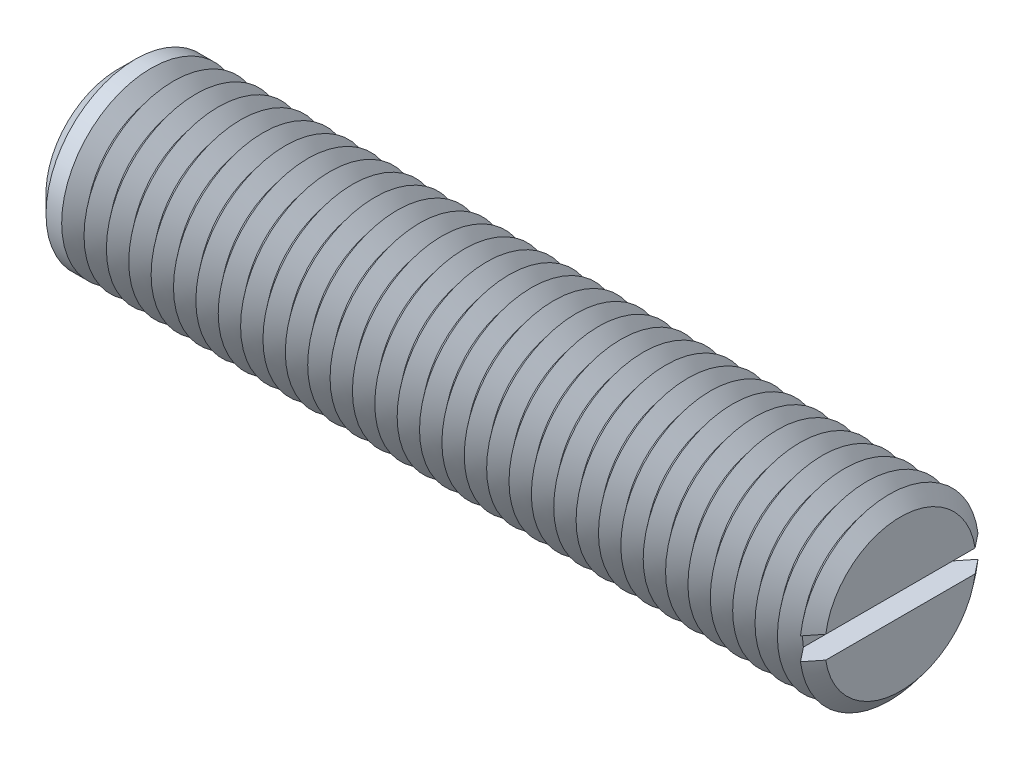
ISO-10303-21;
HEADER;
FILE_DESCRIPTION(('STEP AP214'),'2;1');
FILE_NAME('part.step','',(''),(''),'','','');
FILE_SCHEMA(('AUTOMOTIVE_DESIGN { 1 0 10303 214 1 1 1 1 }'));
ENDSEC;
DATA;
#1=APPLICATION_CONTEXT('core data for automotive mechanical design processes');
#2=APPLICATION_PROTOCOL_DEFINITION('international standard','automotive_design',2000,#1);
#3=PRODUCT_CONTEXT('',#1,'mechanical');
#4=PRODUCT('Part','Part','',(#3));
#5=PRODUCT_RELATED_PRODUCT_CATEGORY('part','',(#4));
#6=PRODUCT_DEFINITION_FORMATION('','',#4);
#7=PRODUCT_DEFINITION_CONTEXT('part definition',#1,'design');
#8=PRODUCT_DEFINITION('design','',#6,#7);
#9=PRODUCT_DEFINITION_SHAPE('','',#8);
#10=(LENGTH_UNIT() NAMED_UNIT(*) SI_UNIT(.MILLI.,.METRE.));
#11=(NAMED_UNIT(*) PLANE_ANGLE_UNIT() SI_UNIT($,.RADIAN.));
#12=(NAMED_UNIT(*) SI_UNIT($,.STERADIAN.) SOLID_ANGLE_UNIT());
#13=UNCERTAINTY_MEASURE_WITH_UNIT(LENGTH_MEASURE(1.E-05),#10,'distance_accuracy_value','');
#14=(GEOMETRIC_REPRESENTATION_CONTEXT(3) GLOBAL_UNCERTAINTY_ASSIGNED_CONTEXT((#13)) GLOBAL_UNIT_ASSIGNED_CONTEXT((#10,
#11,#12)) REPRESENTATION_CONTEXT('',''));
#15=CARTESIAN_POINT('',(0.,0.,0.));
#16=DIRECTION('',(0.,0.,1.));
#17=DIRECTION('',(1.,0.,0.));
#18=AXIS2_PLACEMENT_3D('',#15,#16,#17);
#19=CARTESIAN_POINT('',(34.,0.,0.));
#20=DIRECTION('',(1.,0.,0.));
#21=DIRECTION('',(0.,0.,-1.));
#22=AXIS2_PLACEMENT_3D('',#19,#20,#21);
#23=CONICAL_SURFACE('',#22,8.,0.895664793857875);
#24=CARTESIAN_POINT('',(34.,0.,0.));
#25=DIRECTION('',(-1.,0.,0.));
#26=DIRECTION('',(0.,0.,1.));
#27=AXIS2_PLACEMENT_3D('',#24,#25,#26);
#28=CIRCLE('',#27,8.);
#29=CARTESIAN_POINT('',(34.,-1.,-7.93725393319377));
#30=VERTEX_POINT('',#29);
#31=CARTESIAN_POINT('',(34.,-1.,7.93725393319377));
#32=VERTEX_POINT('',#31);
#33=EDGE_CURVE('E117',#30,#32,#28,.T.);
#34=ORIENTED_EDGE('',*,*,#33,.T.);
#35=CARTESIAN_POINT('',(41.6137872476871,-1.,-17.4810381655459));
#36=CARTESIAN_POINT('',(41.0731000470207,-1.,-16.8046018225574));
#37=CARTESIAN_POINT('',(40.5324624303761,-1.,-16.1281258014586));
#38=CARTESIAN_POINT('',(39.4513425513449,-1.,-14.7749910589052));
#39=CARTESIAN_POINT('',(38.9108602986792,-1.,-14.0983323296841));
#40=CARTESIAN_POINT('',(37.8295593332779,-1.,-12.7440423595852));
#41=CARTESIAN_POINT('',(37.2887409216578,-1.,-12.0664108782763));
#42=CARTESIAN_POINT('',(36.2075665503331,-1.,-10.7108366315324));
#43=CARTESIAN_POINT('',(35.6672105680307,-1.,-10.0328938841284));
#44=CARTESIAN_POINT('',(34.8866021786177,-1.,-9.05235403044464));
#45=CARTESIAN_POINT('',(34.6460332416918,-1.,-8.75000893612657));
#46=CARTESIAN_POINT('',(34.1651110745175,-1.,-8.14514467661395));
#47=CARTESIAN_POINT('',(33.9247578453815,-1.,-7.84262551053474));
#48=CARTESIAN_POINT('',(33.4443170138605,-1.,-7.23730074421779));
#49=CARTESIAN_POINT('',(33.2042294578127,-1.,-6.93449510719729));
#50=CARTESIAN_POINT('',(32.7244992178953,-1.,-6.32854042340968));
#51=CARTESIAN_POINT('',(32.4848565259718,-1.,-6.02539138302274));
#52=CARTESIAN_POINT('',(32.0064209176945,-1.,-5.41876829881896));
#53=CARTESIAN_POINT('',(31.7676275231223,-1.,-5.11529463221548));
#54=CARTESIAN_POINT('',(31.291132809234,-1.,-4.50745556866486));
#55=CARTESIAN_POINT('',(31.0534315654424,-1.,-4.20309011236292));
#56=CARTESIAN_POINT('',(30.6984723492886,-1.,-3.74537358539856));
#57=CARTESIAN_POINT('',(30.580434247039,-1.,-3.59262786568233));
#58=CARTESIAN_POINT('',(30.3451171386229,-1.,-3.28655323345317));
#59=CARTESIAN_POINT('',(30.2278381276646,-1.,-3.13322432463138));
#60=CARTESIAN_POINT('',(29.9944317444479,-1.,-2.82571819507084));
#61=CARTESIAN_POINT('',(29.8783042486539,-1.,-2.67154106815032));
#62=CARTESIAN_POINT('',(29.6478553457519,-1.,-2.36184450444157));
#63=CARTESIAN_POINT('',(29.5335338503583,-1.,-2.20632513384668));
#64=CARTESIAN_POINT('',(29.3956998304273,-1.,-2.01476175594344));
#65=CARTESIAN_POINT('',(29.3706709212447,-1.,-1.97980928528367));
#66=CARTESIAN_POINT('',(29.3208007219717,-1.,-1.90977040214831));
#67=CARTESIAN_POINT('',(29.2959594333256,-1.,-1.87468398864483));
#68=CARTESIAN_POINT('',(29.2217527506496,-1.,-1.76919140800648));
#69=CARTESIAN_POINT('',(29.1727089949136,-1.,-1.69855807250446));
#70=CARTESIAN_POINT('',(29.0751159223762,-1.,-1.55549554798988));
#71=CARTESIAN_POINT('',(29.0265831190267,-1.,-1.48305505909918));
#72=CARTESIAN_POINT('',(28.9312399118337,-1.,-1.33706835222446));
#73=CARTESIAN_POINT('',(28.8844290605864,-1.,-1.26352242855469));
#74=CARTESIAN_POINT('',(28.7926759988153,-1.,-1.1137948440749));
#75=CARTESIAN_POINT('',(28.7477706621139,-1.,-1.03759043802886));
#76=CARTESIAN_POINT('',(28.661907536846,-1.,-0.882780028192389));
#77=CARTESIAN_POINT('',(28.6209558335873,-1.,-0.804170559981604));
#78=CARTESIAN_POINT('',(28.56478469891,-1.,-0.684500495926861));
#79=CARTESIAN_POINT('',(28.5470539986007,-1.,-0.644631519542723));
#80=CARTESIAN_POINT('',(28.5136729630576,-1.,-0.564036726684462));
#81=CARTESIAN_POINT('',(28.4980230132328,-1.,-0.523310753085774));
#82=CARTESIAN_POINT('',(28.4551526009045,-1.,-0.399956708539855));
#83=CARTESIAN_POINT('',(28.4318433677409,-1.,-0.315816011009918));
#84=CARTESIAN_POINT('',(28.4098657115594,-1.,-0.193542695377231));
#85=CARTESIAN_POINT('',(28.4047261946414,-1.,-0.156548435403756));
#86=CARTESIAN_POINT('',(28.3976757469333,-1.,-0.0822397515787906));
#87=CARTESIAN_POINT('',(28.3957650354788,-1.,-0.0449253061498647));
#88=CARTESIAN_POINT('',(28.3953106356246,-1.,0.029693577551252));
#89=CARTESIAN_POINT('',(28.3967642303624,-1.,0.0669979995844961));
#90=CARTESIAN_POINT('',(28.402929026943,-1.,0.141334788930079));
#91=CARTESIAN_POINT('',(28.4076406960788,-1.,0.178367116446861));
#92=CARTESIAN_POINT('',(28.4224195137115,-1.,0.266117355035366));
#93=CARTESIAN_POINT('',(28.4338513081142,-1.,0.316604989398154));
#94=CARTESIAN_POINT('',(28.461310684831,-1.,0.416309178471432));
#95=CARTESIAN_POINT('',(28.4773414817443,-1.,0.465524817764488));
#96=CARTESIAN_POINT('',(28.5130409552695,-1.,0.563049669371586));
#97=CARTESIAN_POINT('',(28.5327381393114,-1.,0.611348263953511));
#98=CARTESIAN_POINT('',(28.5747706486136,-1.,0.70674880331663));
#99=CARTESIAN_POINT('',(28.5971051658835,-1.,0.753851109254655));
#100=CARTESIAN_POINT('',(28.6464135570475,-1.,0.852405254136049));
#101=CARTESIAN_POINT('',(28.6736257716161,-1.,0.903736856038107));
#102=CARTESIAN_POINT('',(28.7298407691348,-1.,1.00541472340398));
#103=CARTESIAN_POINT('',(28.7588439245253,-1.,1.05576078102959));
#104=CARTESIAN_POINT('',(28.8478642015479,-1.,1.20570300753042));
#105=CARTESIAN_POINT('',(28.909851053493,-1.,1.30412495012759));
#106=CARTESIAN_POINT('',(29.0370218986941,-1.,1.49921478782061));
#107=CARTESIAN_POINT('',(29.1022138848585,-1.,1.59587737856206));
#108=CARTESIAN_POINT('',(29.234509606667,-1.,1.78781770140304));
#109=CARTESIAN_POINT('',(29.3016124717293,-1.,1.88309603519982));
#110=CARTESIAN_POINT('',(29.4371969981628,-1.,2.07285006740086));
#111=CARTESIAN_POINT('',(29.5056803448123,-1.,2.16732455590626));
#112=CARTESIAN_POINT('',(29.6435598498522,-1.,2.3556198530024));
#113=CARTESIAN_POINT('',(29.7129561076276,-1.,2.44944058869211));
#114=CARTESIAN_POINT('',(29.8522867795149,-1.,2.63643541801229));
#115=CARTESIAN_POINT('',(29.9222200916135,-1.,2.72961033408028));
#116=CARTESIAN_POINT('',(30.0625737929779,-1.,2.9155867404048));
#117=CARTESIAN_POINT('',(30.1329941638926,-1.,3.00838824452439));
#118=CARTESIAN_POINT('',(30.3434401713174,-1.,3.2845708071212));
#119=CARTESIAN_POINT('',(30.4840068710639,-1.,3.46753938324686));
#120=CARTESIAN_POINT('',(30.766047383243,-1.,3.83277652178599));
#121=CARTESIAN_POINT('',(30.9075212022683,-1.,4.01504507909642));
#122=CARTESIAN_POINT('',(31.3328445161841,-1.,4.56116633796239));
#123=CARTESIAN_POINT('',(31.6175870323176,-1.,4.92432312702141));
#124=CARTESIAN_POINT('',(32.188450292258,-1.,5.64994266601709));
#125=CARTESIAN_POINT('',(32.4745718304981,-1.,6.01240478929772));
#126=CARTESIAN_POINT('',(33.0475166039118,-1.,6.73676512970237));
#127=CARTESIAN_POINT('',(33.334339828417,-1.,7.09866335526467));
#128=CARTESIAN_POINT('',(33.9076446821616,-1.,7.8211222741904));
#129=CARTESIAN_POINT('',(34.1941251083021,-1.,8.18168392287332));
#130=CARTESIAN_POINT('',(34.7673842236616,-1.,8.90257236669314));
#131=CARTESIAN_POINT('',(35.0541629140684,-1.,9.26289916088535));
#132=CARTESIAN_POINT('',(35.9146958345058,-1.,10.3434977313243));
#133=CARTESIAN_POINT('',(36.4887564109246,-1.,11.0635255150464));
#134=CARTESIAN_POINT('',(37.4416309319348,-1.,12.2579358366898));
#135=CARTESIAN_POINT('',(37.8203198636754,-1.,12.7324181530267));
#136=CARTESIAN_POINT('',(38.577860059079,-1.,13.6812951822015));
#137=CARTESIAN_POINT('',(38.9567113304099,-1.,14.1556898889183));
#138=CARTESIAN_POINT('',(39.7152320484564,-1.,15.1052923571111));
#139=CARTESIAN_POINT('',(40.0949016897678,-1.,15.5804999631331));
#140=CARTESIAN_POINT('',(40.8543004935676,-1.,16.5308253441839));
#141=CARTESIAN_POINT('',(41.2340296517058,-1.,17.005943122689));
#142=CARTESIAN_POINT('',(41.6137872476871,-1.,17.4810381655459));
#143=B_SPLINE_CURVE_WITH_KNOTS('',3,(#35,#36,#37,#38,#39,#40,#41,#42,#43,#44,#45,#46,#47,#48,
#49,#50,#51,#52,#53,#54,#55,#56,#57,#58,#59,#60,#61,#62,#63,#64,#65,#66,#67,#68,#69,#70,#71,#72,
#73,#74,#75,#76,#77,#78,#79,#80,#81,#82,#83,#84,#85,#86,#87,#88,#89,#90,#91,#92,#93,#94,#95,#96,
#97,#98,#99,#100,#101,#102,#103,#104,#105,#106,#107,#108,#109,#110,#111,#112,#113,#114,#115,
#116,#117,#118,#119,#120,#121,#122,#123,#124,#125,#126,#127,#128,#129,#130,#131,#132,#133,#134,
#135,#136,#137,#138,#139,#140,#141,#142),.UNSPECIFIED.,.F.,.F.,(4,2,2,2,2,2,2,2,2,2,2,2,2,2,2,2,
2,2,2,2,2,2,2,2,2,2,2,2,2,2,2,2,2,2,2,2,2,2,2,2,2,2,2,2,2,2,2,2,2,2,2,2,2,4),(0.,
2.59791825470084,5.19597381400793,7.79693910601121,10.3977690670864,11.5568952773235,
12.7160274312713,13.8753371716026,15.0346257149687,16.1931009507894,17.3516551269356,
17.9307722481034,18.5098857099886,19.0889363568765,19.6679586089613,19.7969273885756,
19.9258971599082,20.1838595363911,20.4454304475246,20.7069329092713,20.9722220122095,
21.2379131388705,21.3687577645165,21.4996265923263,21.760240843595,21.8721711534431,
21.9841090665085,22.0959566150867,22.2078202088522,22.3628274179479,22.5179432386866,
22.6743197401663,22.8306484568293,23.0048946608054,23.1791772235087,23.5280071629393,
23.8777561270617,24.2273482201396,24.5773965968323,24.927483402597,25.2769811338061,
25.6264657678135,26.3186514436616,27.0108421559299,28.3952670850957,29.7806179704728,
31.1659479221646,32.5474981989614,33.9290539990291,36.6916375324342,38.5128593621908,
40.334179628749,42.1589376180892,43.9835965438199),.UNSPECIFIED.);
#144=CARTESIAN_POINT('',(33.,-1.,6.67652652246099));
#145=VERTEX_POINT('',#144);
#146=EDGE_CURVE('E109',#145,#32,#143,.T.);
#147=ORIENTED_EDGE('',*,*,#146,.F.);
#148=CARTESIAN_POINT('',(33.,0.,0.));
#149=DIRECTION('',(-1.,0.,0.));
#150=DIRECTION('',(0.,0.,1.));
#151=AXIS2_PLACEMENT_3D('',#148,#149,#150);
#152=CIRCLE('',#151,6.75100040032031);
#153=CARTESIAN_POINT('',(33.,-1.,-6.67652652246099));
#154=VERTEX_POINT('',#153);
#155=EDGE_CURVE('E488',#154,#145,#152,.T.);
#156=ORIENTED_EDGE('',*,*,#155,.F.);
#157=EDGE_CURVE('E58',#30,#154,#143,.T.);
#158=ORIENTED_EDGE('',*,*,#157,.F.);
#159=EDGE_LOOP('',(#34,#147,#156,#158));
#160=FACE_BOUND('',#159,.T.);
#161=ADVANCED_FACE('F37',(#160),#23,.T.);
#162=CARTESIAN_POINT('',(34.,1.,7.93725393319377));
#163=VERTEX_POINT('',#162);
#164=CARTESIAN_POINT('',(34.,1.,-7.93725393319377));
#165=VERTEX_POINT('',#164);
#166=EDGE_CURVE('E100',#163,#165,#28,.T.);
#167=ORIENTED_EDGE('',*,*,#166,.T.);
#168=CARTESIAN_POINT('',(41.6137872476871,1.,17.4810381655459));
#169=CARTESIAN_POINT('',(41.0731000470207,1.,16.8046018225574));
#170=CARTESIAN_POINT('',(40.5324624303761,1.,16.1281258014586));
#171=CARTESIAN_POINT('',(39.4513425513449,1.,14.7749910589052));
#172=CARTESIAN_POINT('',(38.9108602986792,1.,14.0983323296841));
#173=CARTESIAN_POINT('',(37.8295593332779,1.,12.7440423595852));
#174=CARTESIAN_POINT('',(37.2887409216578,1.,12.0664108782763));
#175=CARTESIAN_POINT('',(36.2075665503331,1.,10.7108366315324));
#176=CARTESIAN_POINT('',(35.6672105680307,1.,10.0328938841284));
#177=CARTESIAN_POINT('',(34.8866021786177,1.,9.05235403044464));
#178=CARTESIAN_POINT('',(34.6460332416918,1.,8.75000893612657));
#179=CARTESIAN_POINT('',(34.1651110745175,1.,8.14514467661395));
#180=CARTESIAN_POINT('',(33.9247578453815,1.,7.84262551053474));
#181=CARTESIAN_POINT('',(33.4443170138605,1.,7.23730074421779));
#182=CARTESIAN_POINT('',(33.2042294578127,1.,6.93449510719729));
#183=CARTESIAN_POINT('',(32.7244992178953,1.,6.32854042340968));
#184=CARTESIAN_POINT('',(32.4848565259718,1.,6.02539138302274));
#185=CARTESIAN_POINT('',(32.0064209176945,1.,5.41876829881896));
#186=CARTESIAN_POINT('',(31.7676275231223,1.,5.11529463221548));
#187=CARTESIAN_POINT('',(31.291132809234,1.,4.50745556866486));
#188=CARTESIAN_POINT('',(31.0534315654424,1.,4.20309011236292));
#189=CARTESIAN_POINT('',(30.6984723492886,1.,3.74537358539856));
#190=CARTESIAN_POINT('',(30.580434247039,1.,3.59262786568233));
#191=CARTESIAN_POINT('',(30.3451171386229,1.,3.28655323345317));
#192=CARTESIAN_POINT('',(30.2278381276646,1.,3.13322432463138));
#193=CARTESIAN_POINT('',(29.9944317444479,1.,2.82571819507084));
#194=CARTESIAN_POINT('',(29.8783042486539,1.,2.67154106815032));
#195=CARTESIAN_POINT('',(29.6478553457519,1.,2.36184450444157));
#196=CARTESIAN_POINT('',(29.5335338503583,1.,2.20632513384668));
#197=CARTESIAN_POINT('',(29.3956998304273,1.,2.01476175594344));
#198=CARTESIAN_POINT('',(29.3706709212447,1.,1.97980928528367));
#199=CARTESIAN_POINT('',(29.3208007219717,1.,1.90977040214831));
#200=CARTESIAN_POINT('',(29.2959594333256,1.,1.87468398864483));
#201=CARTESIAN_POINT('',(29.2217527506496,1.,1.76919140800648));
#202=CARTESIAN_POINT('',(29.1727089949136,1.,1.69855807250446));
#203=CARTESIAN_POINT('',(29.0751159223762,1.,1.55549554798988));
#204=CARTESIAN_POINT('',(29.0265831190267,1.,1.48305505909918));
#205=CARTESIAN_POINT('',(28.9312399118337,1.,1.33706835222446));
#206=CARTESIAN_POINT('',(28.8844290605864,1.,1.26352242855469));
#207=CARTESIAN_POINT('',(28.7926759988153,1.,1.1137948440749));
#208=CARTESIAN_POINT('',(28.7477706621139,1.,1.03759043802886));
#209=CARTESIAN_POINT('',(28.661907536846,1.,0.882780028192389));
#210=CARTESIAN_POINT('',(28.6209558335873,1.,0.804170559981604));
#211=CARTESIAN_POINT('',(28.56478469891,1.,0.684500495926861));
#212=CARTESIAN_POINT('',(28.5470539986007,1.,0.644631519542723));
#213=CARTESIAN_POINT('',(28.5136729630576,1.,0.564036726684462));
#214=CARTESIAN_POINT('',(28.4980230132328,1.,0.523310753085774));
#215=CARTESIAN_POINT('',(28.4551526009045,1.,0.399956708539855));
#216=CARTESIAN_POINT('',(28.4318433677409,1.,0.315816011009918));
#217=CARTESIAN_POINT('',(28.4098657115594,1.,0.193542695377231));
#218=CARTESIAN_POINT('',(28.4047261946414,1.,0.156548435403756));
#219=CARTESIAN_POINT('',(28.3976757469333,1.,0.0822397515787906));
#220=CARTESIAN_POINT('',(28.3957650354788,1.,0.0449253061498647));
#221=CARTESIAN_POINT('',(28.3953106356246,1.,-0.029693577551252));
#222=CARTESIAN_POINT('',(28.3967642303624,1.,-0.0669979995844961));
#223=CARTESIAN_POINT('',(28.402929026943,1.,-0.141334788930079));
#224=CARTESIAN_POINT('',(28.4076406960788,1.,-0.178367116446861));
#225=CARTESIAN_POINT('',(28.4224195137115,1.,-0.266117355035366));
#226=CARTESIAN_POINT('',(28.4338513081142,1.,-0.316604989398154));
#227=CARTESIAN_POINT('',(28.461310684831,1.,-0.416309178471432));
#228=CARTESIAN_POINT('',(28.4773414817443,1.,-0.465524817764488));
#229=CARTESIAN_POINT('',(28.5130409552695,1.,-0.563049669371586));
#230=CARTESIAN_POINT('',(28.5327381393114,1.,-0.611348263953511));
#231=CARTESIAN_POINT('',(28.5747706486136,1.,-0.70674880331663));
#232=CARTESIAN_POINT('',(28.5971051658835,1.,-0.753851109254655));
#233=CARTESIAN_POINT('',(28.6464135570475,1.,-0.852405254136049));
#234=CARTESIAN_POINT('',(28.6736257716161,1.,-0.903736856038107));
#235=CARTESIAN_POINT('',(28.7298407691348,1.,-1.00541472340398));
#236=CARTESIAN_POINT('',(28.7588439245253,1.,-1.05576078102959));
#237=CARTESIAN_POINT('',(28.8478642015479,1.,-1.20570300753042));
#238=CARTESIAN_POINT('',(28.909851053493,1.,-1.30412495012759));
#239=CARTESIAN_POINT('',(29.0370218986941,1.,-1.49921478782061));
#240=CARTESIAN_POINT('',(29.1022138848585,1.,-1.59587737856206));
#241=CARTESIAN_POINT('',(29.234509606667,1.,-1.78781770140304));
#242=CARTESIAN_POINT('',(29.3016124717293,1.,-1.88309603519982));
#243=CARTESIAN_POINT('',(29.4371969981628,1.,-2.07285006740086));
#244=CARTESIAN_POINT('',(29.5056803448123,1.,-2.16732455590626));
#245=CARTESIAN_POINT('',(29.6435598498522,1.,-2.3556198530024));
#246=CARTESIAN_POINT('',(29.7129561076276,1.,-2.44944058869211));
#247=CARTESIAN_POINT('',(29.8522867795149,1.,-2.63643541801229));
#248=CARTESIAN_POINT('',(29.9222200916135,1.,-2.72961033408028));
#249=CARTESIAN_POINT('',(30.0625737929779,1.,-2.9155867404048));
#250=CARTESIAN_POINT('',(30.1329941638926,1.,-3.00838824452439));
#251=CARTESIAN_POINT('',(30.3434401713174,1.,-3.2845708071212));
#252=CARTESIAN_POINT('',(30.4840068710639,1.,-3.46753938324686));
#253=CARTESIAN_POINT('',(30.766047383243,1.,-3.83277652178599));
#254=CARTESIAN_POINT('',(30.9075212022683,1.,-4.01504507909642));
#255=CARTESIAN_POINT('',(31.3328445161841,1.,-4.56116633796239));
#256=CARTESIAN_POINT('',(31.6175870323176,1.,-4.92432312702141));
#257=CARTESIAN_POINT('',(32.188450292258,1.,-5.64994266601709));
#258=CARTESIAN_POINT('',(32.4745718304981,1.,-6.01240478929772));
#259=CARTESIAN_POINT('',(33.0475166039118,1.,-6.73676512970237));
#260=CARTESIAN_POINT('',(33.334339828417,1.,-7.09866335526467));
#261=CARTESIAN_POINT('',(33.9076446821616,1.,-7.8211222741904));
#262=CARTESIAN_POINT('',(34.1941251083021,1.,-8.18168392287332));
#263=CARTESIAN_POINT('',(34.7673842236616,1.,-8.90257236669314));
#264=CARTESIAN_POINT('',(35.0541629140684,1.,-9.26289916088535));
#265=CARTESIAN_POINT('',(35.9146958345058,1.,-10.3434977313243));
#266=CARTESIAN_POINT('',(36.4887564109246,1.,-11.0635255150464));
#267=CARTESIAN_POINT('',(37.4416309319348,1.,-12.2579358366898));
#268=CARTESIAN_POINT('',(37.8203198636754,1.,-12.7324181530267));
#269=CARTESIAN_POINT('',(38.577860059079,1.,-13.6812951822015));
#270=CARTESIAN_POINT('',(38.9567113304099,1.,-14.1556898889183));
#271=CARTESIAN_POINT('',(39.7152320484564,1.,-15.1052923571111));
#272=CARTESIAN_POINT('',(40.0949016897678,1.,-15.5804999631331));
#273=CARTESIAN_POINT('',(40.8543004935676,1.,-16.5308253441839));
#274=CARTESIAN_POINT('',(41.2340296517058,1.,-17.005943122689));
#275=CARTESIAN_POINT('',(41.6137872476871,1.,-17.4810381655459));
#276=B_SPLINE_CURVE_WITH_KNOTS('',3,(#168,#169,#170,#171,#172,#173,#174,#175,#176,#177,#178,
#179,#180,#181,#182,#183,#184,#185,#186,#187,#188,#189,#190,#191,#192,#193,#194,#195,#196,#197,
#198,#199,#200,#201,#202,#203,#204,#205,#206,#207,#208,#209,#210,#211,#212,#213,#214,#215,#216,
#217,#218,#219,#220,#221,#222,#223,#224,#225,#226,#227,#228,#229,#230,#231,#232,#233,#234,#235,
#236,#237,#238,#239,#240,#241,#242,#243,#244,#245,#246,#247,#248,#249,#250,#251,#252,#253,#254,
#255,#256,#257,#258,#259,#260,#261,#262,#263,#264,#265,#266,#267,#268,#269,#270,#271,#272,#273,
#274,#275),.UNSPECIFIED.,.F.,.F.,(4,2,2,2,2,2,2,2,2,2,2,2,2,2,2,2,2,2,2,2,2,2,2,2,2,2,2,2,2,2,2,
2,2,2,2,2,2,2,2,2,2,2,2,2,2,2,2,2,2,2,2,2,2,4),(0.,2.59791825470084,5.19597381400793,
7.79693910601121,10.3977690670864,11.5568952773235,12.7160274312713,13.8753371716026,
15.0346257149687,16.1931009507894,17.3516551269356,17.9307722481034,18.5098857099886,
19.0889363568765,19.6679586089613,19.7969273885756,19.9258971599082,20.1838595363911,
20.4454304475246,20.7069329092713,20.9722220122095,21.2379131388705,21.3687577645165,
21.4996265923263,21.760240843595,21.8721711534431,21.9841090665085,22.0959566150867,
22.2078202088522,22.3628274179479,22.5179432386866,22.6743197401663,22.8306484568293,
23.0048946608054,23.1791772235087,23.5280071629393,23.8777561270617,24.2273482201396,
24.5773965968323,24.927483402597,25.2769811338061,25.6264657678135,26.3186514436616,
27.0108421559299,28.3952670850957,29.7806179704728,31.1659479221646,32.5474981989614,
33.9290539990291,36.6916375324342,38.5128593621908,40.334179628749,42.1589376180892,
43.9835965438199),.UNSPECIFIED.);
#277=CARTESIAN_POINT('',(33.,1.,-6.67652652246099));
#278=VERTEX_POINT('',#277);
#279=EDGE_CURVE('E110',#278,#165,#276,.T.);
#280=ORIENTED_EDGE('',*,*,#279,.F.);
#281=CARTESIAN_POINT('',(33.,1.,6.67652652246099));
#282=VERTEX_POINT('',#281);
#283=EDGE_CURVE('E103',#282,#278,#152,.T.);
#284=ORIENTED_EDGE('',*,*,#283,.F.);
#285=EDGE_CURVE('E97',#163,#282,#276,.T.);
#286=ORIENTED_EDGE('',*,*,#285,.F.);
#287=EDGE_LOOP('',(#167,#280,#284,#286));
#288=FACE_BOUND('',#287,.T.);
#289=ADVANCED_FACE('F99',(#288),#23,.T.);
#290=CARTESIAN_POINT('',(33.,0.,0.));
#291=DIRECTION('',(-1.,0.,0.));
#292=DIRECTION('',(0.,0.,1.));
#293=AXIS2_PLACEMENT_3D('',#290,#291,#292);
#294=CONICAL_SURFACE('',#293,6.75100040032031,0.895664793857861);
#295=CARTESIAN_POINT('',(32.,0.,0.));
#296=DIRECTION('',(-1.,0.,0.));
#297=DIRECTION('',(0.,0.,1.));
#298=AXIS2_PLACEMENT_3D('',#295,#296,#297);
#299=CIRCLE('',#298,8.);
#300=CARTESIAN_POINT('',(32.,0.,8.));
#301=VERTEX_POINT('',#300);
#302=EDGE_CURVE('E475',#301,#301,#299,.T.);
#303=ORIENTED_EDGE('',*,*,#302,.F.);
#304=EDGE_LOOP('',(#303));
#305=FACE_BOUND('',#304,.T.);
#306=ORIENTED_EDGE('',*,*,#283,.T.);
#307=EDGE_CURVE('E482',#278,#154,#152,.T.);
#308=ORIENTED_EDGE('',*,*,#307,.T.);
#309=ORIENTED_EDGE('',*,*,#155,.T.);
#310=EDGE_CURVE('E481',#145,#282,#152,.T.);
#311=ORIENTED_EDGE('',*,*,#310,.T.);
#312=EDGE_LOOP('',(#306,#308,#309,#311));
#313=FACE_BOUND('',#312,.T.);
#314=ADVANCED_FACE('F167',(#305,#313),#294,.T.);
#315=CARTESIAN_POINT('',(35.,0.,0.));
#316=DIRECTION('',(1.,0.,0.));
#317=DIRECTION('',(0.,0.,-1.));
#318=AXIS2_PLACEMENT_3D('',#315,#316,#317);
#319=PLANE('',#318);
#320=CARTESIAN_POINT('',(35.,0.,0.));
#321=DIRECTION('',(-1.,0.,0.));
#322=DIRECTION('',(0.,0.,1.));
#323=AXIS2_PLACEMENT_3D('',#320,#321,#322);
#324=CIRCLE('',#323,6.75100040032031);
#325=CARTESIAN_POINT('',(35.,1.,6.67652652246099));
#326=VERTEX_POINT('',#325);
#327=CARTESIAN_POINT('',(35.,1.,-6.67652652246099));
#328=VERTEX_POINT('',#327);
#329=EDGE_CURVE('E159',#326,#328,#324,.T.);
#330=ORIENTED_EDGE('',*,*,#329,.F.);
#331=DIRECTION('',(0.,0.,1.));
#332=VECTOR('',#331,1.);
#333=CARTESIAN_POINT('',(35.,1.,0.));
#334=LINE('',#333,#332);
#335=EDGE_CURVE('E122',#328,#326,#334,.T.);
#336=ORIENTED_EDGE('',*,*,#335,.F.);
#337=EDGE_LOOP('',(#330,#336));
#338=FACE_BOUND('',#337,.T.);
#339=ADVANCED_FACE('F171',(#338),#319,.T.);
#340=CARTESIAN_POINT('',(35.,-1.,-6.67652652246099));
#341=VERTEX_POINT('',#340);
#342=CARTESIAN_POINT('',(35.,-1.,6.67652652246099));
#343=VERTEX_POINT('',#342);
#344=EDGE_CURVE('E66',#341,#343,#324,.T.);
#345=ORIENTED_EDGE('',*,*,#344,.F.);
#346=DIRECTION('',(0.,0.,-1.));
#347=VECTOR('',#346,1.);
#348=CARTESIAN_POINT('',(35.,-1.,0.));
#349=LINE('',#348,#347);
#350=EDGE_CURVE('E136',#343,#341,#349,.T.);
#351=ORIENTED_EDGE('',*,*,#350,.F.);
#352=EDGE_LOOP('',(#345,#351));
#353=FACE_BOUND('',#352,.T.);
#354=ADVANCED_FACE('F201',(#353),#319,.T.);
#355=CARTESIAN_POINT('',(35.,0.,0.));
#356=DIRECTION('',(-1.,0.,0.));
#357=DIRECTION('',(0.,0.,1.));
#358=AXIS2_PLACEMENT_3D('',#355,#356,#357);
#359=CONICAL_SURFACE('',#358,6.75100040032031,0.895664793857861);
#360=ORIENTED_EDGE('',*,*,#166,.F.);
#361=CARTESIAN_POINT('',(26.3862127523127,1.,-17.4810381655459));
#362=CARTESIAN_POINT('',(26.9268999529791,1.,-16.8046018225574));
#363=CARTESIAN_POINT('',(27.4675375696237,1.,-16.1281258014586));
#364=CARTESIAN_POINT('',(28.5486574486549,1.,-14.7749910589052));
#365=CARTESIAN_POINT('',(29.0891397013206,1.,-14.0983323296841));
#366=CARTESIAN_POINT('',(30.1704406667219,1.,-12.7440423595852));
#367=CARTESIAN_POINT('',(30.711259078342,1.,-12.0664108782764));
#368=CARTESIAN_POINT('',(31.7924334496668,1.,-10.7108366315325));
#369=CARTESIAN_POINT('',(32.3327894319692,1.,-10.0328938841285));
#370=CARTESIAN_POINT('',(33.1133978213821,1.,-9.05235403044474));
#371=CARTESIAN_POINT('',(33.3539667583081,1.,-8.75000893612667));
#372=CARTESIAN_POINT('',(33.8348889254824,1.,-8.14514467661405));
#373=CARTESIAN_POINT('',(34.0752421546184,1.,-7.84262551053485));
#374=CARTESIAN_POINT('',(34.5556829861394,1.,-7.23730074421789));
#375=CARTESIAN_POINT('',(34.7957705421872,1.,-6.93449510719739));
#376=CARTESIAN_POINT('',(35.2755007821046,1.,-6.32854042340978));
#377=CARTESIAN_POINT('',(35.5151434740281,1.,-6.02539138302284));
#378=CARTESIAN_POINT('',(35.9935790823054,1.,-5.41876829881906));
#379=CARTESIAN_POINT('',(36.2323724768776,1.,-5.11529463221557));
#380=CARTESIAN_POINT('',(36.708867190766,1.,-4.50745556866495));
#381=CARTESIAN_POINT('',(36.9465684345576,1.,-4.20309011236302));
#382=CARTESIAN_POINT('',(37.3015276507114,1.,-3.74537358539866));
#383=CARTESIAN_POINT('',(37.419565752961,1.,-3.59262786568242));
#384=CARTESIAN_POINT('',(37.6548828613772,1.,-3.28655323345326));
#385=CARTESIAN_POINT('',(37.7721618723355,1.,-3.13322432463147));
#386=CARTESIAN_POINT('',(38.0055682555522,1.,-2.82571819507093));
#387=CARTESIAN_POINT('',(38.1216957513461,1.,-2.67154106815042));
#388=CARTESIAN_POINT('',(38.3521446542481,1.,-2.36184450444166));
#389=CARTESIAN_POINT('',(38.4664661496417,1.,-2.20632513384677));
#390=CARTESIAN_POINT('',(38.6043001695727,1.,-2.01476175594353));
#391=CARTESIAN_POINT('',(38.6293290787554,1.,-1.97980928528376));
#392=CARTESIAN_POINT('',(38.6791992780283,1.,-1.9097704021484));
#393=CARTESIAN_POINT('',(38.7040405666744,1.,-1.87468398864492));
#394=CARTESIAN_POINT('',(38.7782472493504,1.,-1.76919140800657));
#395=CARTESIAN_POINT('',(38.8272910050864,1.,-1.69855807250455));
#396=CARTESIAN_POINT('',(38.9248840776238,1.,-1.55549554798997));
#397=CARTESIAN_POINT('',(38.9734168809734,1.,-1.48305505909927));
#398=CARTESIAN_POINT('',(39.0687600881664,1.,-1.33706835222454));
#399=CARTESIAN_POINT('',(39.1155709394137,1.,-1.26352242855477));
#400=CARTESIAN_POINT('',(39.2073240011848,1.,-1.11379484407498));
#401=CARTESIAN_POINT('',(39.2522293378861,1.,-1.03759043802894));
#402=CARTESIAN_POINT('',(39.3380924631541,1.,-0.882780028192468));
#403=CARTESIAN_POINT('',(39.3790441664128,1.,-0.804170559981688));
#404=CARTESIAN_POINT('',(39.4352153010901,1.,-0.684500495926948));
#405=CARTESIAN_POINT('',(39.4529460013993,1.,-0.64463151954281));
#406=CARTESIAN_POINT('',(39.4863270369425,1.,-0.564036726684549));
#407=CARTESIAN_POINT('',(39.5019769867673,1.,-0.523310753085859));
#408=CARTESIAN_POINT('',(39.5448473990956,1.,-0.399956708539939));
#409=CARTESIAN_POINT('',(39.5681566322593,1.,-0.31581601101));
#410=CARTESIAN_POINT('',(39.5901342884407,1.,-0.193542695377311));
#411=CARTESIAN_POINT('',(39.5952738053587,1.,-0.156548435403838));
#412=CARTESIAN_POINT('',(39.6023242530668,1.,-0.0822397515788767));
#413=CARTESIAN_POINT('',(39.6042349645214,1.,-0.0449253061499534));
#414=CARTESIAN_POINT('',(39.6046893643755,1.,0.0296935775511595));
#415=CARTESIAN_POINT('',(39.6032357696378,1.,0.0669979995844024));
#416=CARTESIAN_POINT('',(39.5970709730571,1.,0.141334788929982));
#417=CARTESIAN_POINT('',(39.5923593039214,1.,0.178367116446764));
#418=CARTESIAN_POINT('',(39.5775804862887,1.,0.266117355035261));
#419=CARTESIAN_POINT('',(39.5661486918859,1.,0.316604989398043));
#420=CARTESIAN_POINT('',(39.5386893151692,1.,0.416309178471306));
#421=CARTESIAN_POINT('',(39.5226585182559,1.,0.465524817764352));
#422=CARTESIAN_POINT('',(39.4869590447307,1.,0.563049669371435));
#423=CARTESIAN_POINT('',(39.4672618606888,1.,0.611348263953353));
#424=CARTESIAN_POINT('',(39.4252293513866,1.,0.706748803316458));
#425=CARTESIAN_POINT('',(39.4028948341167,1.,0.753851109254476));
#426=CARTESIAN_POINT('',(39.3535864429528,1.,0.85240525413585));
#427=CARTESIAN_POINT('',(39.3263742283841,1.,0.903736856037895));
#428=CARTESIAN_POINT('',(39.2701592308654,1.,1.00541472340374));
#429=CARTESIAN_POINT('',(39.241156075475,1.,1.05576078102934));
#430=CARTESIAN_POINT('',(39.1521357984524,1.,1.20570300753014));
#431=CARTESIAN_POINT('',(39.0901489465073,1.,1.30412495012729));
#432=CARTESIAN_POINT('',(38.9629781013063,1.,1.49921478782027));
#433=CARTESIAN_POINT('',(38.8977861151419,1.,1.59587737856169));
#434=CARTESIAN_POINT('',(38.7654903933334,1.,1.78781770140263));
#435=CARTESIAN_POINT('',(38.6983875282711,1.,1.88309603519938));
#436=CARTESIAN_POINT('',(38.5628030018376,1.,2.07285006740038));
#437=CARTESIAN_POINT('',(38.4943196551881,1.,2.16732455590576));
#438=CARTESIAN_POINT('',(38.3564401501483,1.,2.35561985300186));
#439=CARTESIAN_POINT('',(38.2870438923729,1.,2.44944058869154));
#440=CARTESIAN_POINT('',(38.1477132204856,1.,2.63643541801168));
#441=CARTESIAN_POINT('',(38.0777799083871,1.,2.72961033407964));
#442=CARTESIAN_POINT('',(37.9374262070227,1.,2.91558674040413));
#443=CARTESIAN_POINT('',(37.867005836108,1.,3.00838824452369));
#444=CARTESIAN_POINT('',(37.6565598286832,1.,3.28457080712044));
#445=CARTESIAN_POINT('',(37.5159931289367,1.,3.46753938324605));
#446=CARTESIAN_POINT('',(37.2339526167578,1.,3.8327765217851));
#447=CARTESIAN_POINT('',(37.0924787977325,1.,4.01504507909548));
#448=CARTESIAN_POINT('',(36.6671554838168,1.,4.56116633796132));
#449=CARTESIAN_POINT('',(36.3824129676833,1.,4.92432312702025));
#450=CARTESIAN_POINT('',(35.8115497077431,1.,5.64994266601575));
#451=CARTESIAN_POINT('',(35.5254281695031,1.,6.01240478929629));
#452=CARTESIAN_POINT('',(34.9524833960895,1.,6.73676512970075));
#453=CARTESIAN_POINT('',(34.6656601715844,1.,7.09866335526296));
#454=CARTESIAN_POINT('',(34.0923553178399,1.,7.82112227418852));
#455=CARTESIAN_POINT('',(33.8058748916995,1.,8.18168392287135));
#456=CARTESIAN_POINT('',(33.2326157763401,1.,8.90257236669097));
#457=CARTESIAN_POINT('',(32.9458370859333,1.,9.2628991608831));
#458=CARTESIAN_POINT('',(32.0853041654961,1.,10.3434977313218));
#459=CARTESIAN_POINT('',(31.5112435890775,1.,11.0635255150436));
#460=CARTESIAN_POINT('',(30.5583690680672,1.,12.2579358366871));
#461=CARTESIAN_POINT('',(30.1796801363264,1.,12.7324181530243));
#462=CARTESIAN_POINT('',(29.4221399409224,1.,13.6812951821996));
#463=CARTESIAN_POINT('',(29.0432886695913,1.,14.1556898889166));
#464=CARTESIAN_POINT('',(28.2847679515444,1.,15.1052923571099));
#465=CARTESIAN_POINT('',(27.9050983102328,1.,15.5804999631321));
#466=CARTESIAN_POINT('',(27.1456995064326,1.,16.5308253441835));
#467=CARTESIAN_POINT('',(26.7659703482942,1.,17.0059431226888));
#468=CARTESIAN_POINT('',(26.3862127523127,1.,17.4810381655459));
#469=B_SPLINE_CURVE_WITH_KNOTS('',3,(#361,#362,#363,#364,#365,#366,#367,#368,#369,#370,#371,
#372,#373,#374,#375,#376,#377,#378,#379,#380,#381,#382,#383,#384,#385,#386,#387,#388,#389,#390,
#391,#392,#393,#394,#395,#396,#397,#398,#399,#400,#401,#402,#403,#404,#405,#406,#407,#408,#409,
#410,#411,#412,#413,#414,#415,#416,#417,#418,#419,#420,#421,#422,#423,#424,#425,#426,#427,#428,
#429,#430,#431,#432,#433,#434,#435,#436,#437,#438,#439,#440,#441,#442,#443,#444,#445,#446,#447,
#448,#449,#450,#451,#452,#453,#454,#455,#456,#457,#458,#459,#460,#461,#462,#463,#464,#465,#466,
#467,#468),.UNSPECIFIED.,.F.,.F.,(4,2,2,2,2,2,2,2,2,2,2,2,2,2,2,2,2,2,2,2,2,2,2,2,2,2,2,2,2,2,2,
2,2,2,2,2,2,2,2,2,2,2,2,2,2,2,2,2,2,2,2,2,2,4),(0.,2.59791825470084,5.19597381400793,
7.7969391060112,10.3977690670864,11.5568952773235,12.7160274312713,13.8753371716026,
15.0346257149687,16.1931009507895,17.3516551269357,17.9307722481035,18.5098857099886,
19.0889363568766,19.6679586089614,19.7969273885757,19.9258971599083,20.1838595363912,
20.4454304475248,20.7069329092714,20.9722220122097,21.2379131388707,21.3687577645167,
21.4996265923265,21.7602408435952,21.8721711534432,21.9841090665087,22.0959566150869,
22.2078202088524,22.3628274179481,22.5179432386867,22.6743197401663,22.8306484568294,
23.0048946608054,23.1791772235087,23.5280071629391,23.8777561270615,24.2273482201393,
24.5773965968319,24.9274834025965,25.2769811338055,25.6264657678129,26.3186514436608,
27.010842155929,28.3952670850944,29.7806179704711,31.1659479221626,32.5474981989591,
33.9290539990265,36.6916375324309,38.5128593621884,40.3341796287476,42.1589376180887,
43.9835965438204),.UNSPECIFIED.);
#470=EDGE_CURVE('E41',#326,#163,#469,.T.);
#471=ORIENTED_EDGE('',*,*,#470,.F.);
#472=ORIENTED_EDGE('',*,*,#329,.T.);
#473=EDGE_CURVE('E11',#165,#328,#469,.T.);
#474=ORIENTED_EDGE('',*,*,#473,.F.);
#475=EDGE_LOOP('',(#360,#471,#472,#474));
#476=FACE_BOUND('',#475,.T.);
#477=ADVANCED_FACE('F114',(#476),#359,.T.);
#478=CARTESIAN_POINT('',(35.,1.,-12.));
#479=DIRECTION('',(0.,1.,0.));
#480=DIRECTION('',(0.,0.,1.));
#481=AXIS2_PLACEMENT_3D('',#478,#479,#480);
#482=PLANE('',#481);
#483=ORIENTED_EDGE('',*,*,#470,.T.);
#484=ORIENTED_EDGE('',*,*,#285,.T.);
#485=DIRECTION('',(0.,0.,1.));
#486=VECTOR('',#485,1.);
#487=CARTESIAN_POINT('',(33.,1.,-12.));
#488=LINE('',#487,#486);
#489=EDGE_CURVE('E145',#278,#282,#488,.T.);
#490=ORIENTED_EDGE('',*,*,#489,.F.);
#491=ORIENTED_EDGE('',*,*,#279,.T.);
#492=ORIENTED_EDGE('',*,*,#473,.T.);
#493=ORIENTED_EDGE('',*,*,#335,.T.);
#494=EDGE_LOOP('',(#483,#484,#490,#491,#492,#493));
#495=FACE_BOUND('',#494,.T.);
#496=ADVANCED_FACE('F120',(#495),#482,.F.);
#497=ORIENTED_EDGE('',*,*,#33,.F.);
#498=CARTESIAN_POINT('',(26.3862127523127,-1.,17.4810381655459));
#499=CARTESIAN_POINT('',(26.9268999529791,-1.,16.8046018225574));
#500=CARTESIAN_POINT('',(27.4675375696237,-1.,16.1281258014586));
#501=CARTESIAN_POINT('',(28.5486574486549,-1.,14.7749910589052));
#502=CARTESIAN_POINT('',(29.0891397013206,-1.,14.0983323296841));
#503=CARTESIAN_POINT('',(30.1704406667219,-1.,12.7440423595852));
#504=CARTESIAN_POINT('',(30.711259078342,-1.,12.0664108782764));
#505=CARTESIAN_POINT('',(31.7924334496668,-1.,10.7108366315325));
#506=CARTESIAN_POINT('',(32.3327894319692,-1.,10.0328938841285));
#507=CARTESIAN_POINT('',(33.1133978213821,-1.,9.05235403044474));
#508=CARTESIAN_POINT('',(33.3539667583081,-1.,8.75000893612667));
#509=CARTESIAN_POINT('',(33.8348889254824,-1.,8.14514467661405));
#510=CARTESIAN_POINT('',(34.0752421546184,-1.,7.84262551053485));
#511=CARTESIAN_POINT('',(34.5556829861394,-1.,7.23730074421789));
#512=CARTESIAN_POINT('',(34.7957705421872,-1.,6.93449510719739));
#513=CARTESIAN_POINT('',(35.2755007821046,-1.,6.32854042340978));
#514=CARTESIAN_POINT('',(35.5151434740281,-1.,6.02539138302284));
#515=CARTESIAN_POINT('',(35.9935790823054,-1.,5.41876829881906));
#516=CARTESIAN_POINT('',(36.2323724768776,-1.,5.11529463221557));
#517=CARTESIAN_POINT('',(36.708867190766,-1.,4.50745556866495));
#518=CARTESIAN_POINT('',(36.9465684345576,-1.,4.20309011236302));
#519=CARTESIAN_POINT('',(37.3015276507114,-1.,3.74537358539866));
#520=CARTESIAN_POINT('',(37.419565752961,-1.,3.59262786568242));
#521=CARTESIAN_POINT('',(37.6548828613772,-1.,3.28655323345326));
#522=CARTESIAN_POINT('',(37.7721618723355,-1.,3.13322432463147));
#523=CARTESIAN_POINT('',(38.0055682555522,-1.,2.82571819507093));
#524=CARTESIAN_POINT('',(38.1216957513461,-1.,2.67154106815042));
#525=CARTESIAN_POINT('',(38.3521446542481,-1.,2.36184450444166));
#526=CARTESIAN_POINT('',(38.4664661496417,-1.,2.20632513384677));
#527=CARTESIAN_POINT('',(38.6043001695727,-1.,2.01476175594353));
#528=CARTESIAN_POINT('',(38.6293290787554,-1.,1.97980928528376));
#529=CARTESIAN_POINT('',(38.6791992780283,-1.,1.9097704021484));
#530=CARTESIAN_POINT('',(38.7040405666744,-1.,1.87468398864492));
#531=CARTESIAN_POINT('',(38.7782472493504,-1.,1.76919140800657));
#532=CARTESIAN_POINT('',(38.8272910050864,-1.,1.69855807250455));
#533=CARTESIAN_POINT('',(38.9248840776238,-1.,1.55549554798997));
#534=CARTESIAN_POINT('',(38.9734168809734,-1.,1.48305505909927));
#535=CARTESIAN_POINT('',(39.0687600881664,-1.,1.33706835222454));
#536=CARTESIAN_POINT('',(39.1155709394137,-1.,1.26352242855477));
#537=CARTESIAN_POINT('',(39.2073240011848,-1.,1.11379484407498));
#538=CARTESIAN_POINT('',(39.2522293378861,-1.,1.03759043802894));
#539=CARTESIAN_POINT('',(39.3380924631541,-1.,0.882780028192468));
#540=CARTESIAN_POINT('',(39.3790441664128,-1.,0.804170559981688));
#541=CARTESIAN_POINT('',(39.4352153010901,-1.,0.684500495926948));
#542=CARTESIAN_POINT('',(39.4529460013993,-1.,0.64463151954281));
#543=CARTESIAN_POINT('',(39.4863270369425,-1.,0.564036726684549));
#544=CARTESIAN_POINT('',(39.5019769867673,-1.,0.523310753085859));
#545=CARTESIAN_POINT('',(39.5448473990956,-1.,0.399956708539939));
#546=CARTESIAN_POINT('',(39.5681566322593,-1.,0.31581601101));
#547=CARTESIAN_POINT('',(39.5901342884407,-1.,0.193542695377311));
#548=CARTESIAN_POINT('',(39.5952738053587,-1.,0.156548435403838));
#549=CARTESIAN_POINT('',(39.6023242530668,-1.,0.0822397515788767));
#550=CARTESIAN_POINT('',(39.6042349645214,-1.,0.0449253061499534));
#551=CARTESIAN_POINT('',(39.6046893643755,-1.,-0.0296935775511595));
#552=CARTESIAN_POINT('',(39.6032357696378,-1.,-0.0669979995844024));
#553=CARTESIAN_POINT('',(39.5970709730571,-1.,-0.141334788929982));
#554=CARTESIAN_POINT('',(39.5923593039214,-1.,-0.178367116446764));
#555=CARTESIAN_POINT('',(39.5775804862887,-1.,-0.266117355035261));
#556=CARTESIAN_POINT('',(39.5661486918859,-1.,-0.316604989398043));
#557=CARTESIAN_POINT('',(39.5386893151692,-1.,-0.416309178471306));
#558=CARTESIAN_POINT('',(39.5226585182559,-1.,-0.465524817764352));
#559=CARTESIAN_POINT('',(39.4869590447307,-1.,-0.563049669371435));
#560=CARTESIAN_POINT('',(39.4672618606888,-1.,-0.611348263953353));
#561=CARTESIAN_POINT('',(39.4252293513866,-1.,-0.706748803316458));
#562=CARTESIAN_POINT('',(39.4028948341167,-1.,-0.753851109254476));
#563=CARTESIAN_POINT('',(39.3535864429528,-1.,-0.85240525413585));
#564=CARTESIAN_POINT('',(39.3263742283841,-1.,-0.903736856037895));
#565=CARTESIAN_POINT('',(39.2701592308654,-1.,-1.00541472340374));
#566=CARTESIAN_POINT('',(39.241156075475,-1.,-1.05576078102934));
#567=CARTESIAN_POINT('',(39.1521357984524,-1.,-1.20570300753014));
#568=CARTESIAN_POINT('',(39.0901489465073,-1.,-1.30412495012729));
#569=CARTESIAN_POINT('',(38.9629781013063,-1.,-1.49921478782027));
#570=CARTESIAN_POINT('',(38.8977861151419,-1.,-1.59587737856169));
#571=CARTESIAN_POINT('',(38.7654903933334,-1.,-1.78781770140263));
#572=CARTESIAN_POINT('',(38.6983875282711,-1.,-1.88309603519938));
#573=CARTESIAN_POINT('',(38.5628030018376,-1.,-2.07285006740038));
#574=CARTESIAN_POINT('',(38.4943196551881,-1.,-2.16732455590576));
#575=CARTESIAN_POINT('',(38.3564401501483,-1.,-2.35561985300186));
#576=CARTESIAN_POINT('',(38.2870438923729,-1.,-2.44944058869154));
#577=CARTESIAN_POINT('',(38.1477132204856,-1.,-2.63643541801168));
#578=CARTESIAN_POINT('',(38.0777799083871,-1.,-2.72961033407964));
#579=CARTESIAN_POINT('',(37.9374262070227,-1.,-2.91558674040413));
#580=CARTESIAN_POINT('',(37.867005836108,-1.,-3.00838824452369));
#581=CARTESIAN_POINT('',(37.6565598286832,-1.,-3.28457080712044));
#582=CARTESIAN_POINT('',(37.5159931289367,-1.,-3.46753938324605));
#583=CARTESIAN_POINT('',(37.2339526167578,-1.,-3.8327765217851));
#584=CARTESIAN_POINT('',(37.0924787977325,-1.,-4.01504507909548));
#585=CARTESIAN_POINT('',(36.6671554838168,-1.,-4.56116633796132));
#586=CARTESIAN_POINT('',(36.3824129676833,-1.,-4.92432312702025));
#587=CARTESIAN_POINT('',(35.8115497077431,-1.,-5.64994266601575));
#588=CARTESIAN_POINT('',(35.5254281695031,-1.,-6.01240478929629));
#589=CARTESIAN_POINT('',(34.9524833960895,-1.,-6.73676512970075));
#590=CARTESIAN_POINT('',(34.6656601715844,-1.,-7.09866335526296));
#591=CARTESIAN_POINT('',(34.0923553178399,-1.,-7.82112227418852));
#592=CARTESIAN_POINT('',(33.8058748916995,-1.,-8.18168392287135));
#593=CARTESIAN_POINT('',(33.2326157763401,-1.,-8.90257236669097));
#594=CARTESIAN_POINT('',(32.9458370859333,-1.,-9.2628991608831));
#595=CARTESIAN_POINT('',(32.0853041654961,-1.,-10.3434977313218));
#596=CARTESIAN_POINT('',(31.5112435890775,-1.,-11.0635255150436));
#597=CARTESIAN_POINT('',(30.5583690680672,-1.,-12.2579358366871));
#598=CARTESIAN_POINT('',(30.1796801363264,-1.,-12.7324181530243));
#599=CARTESIAN_POINT('',(29.4221399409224,-1.,-13.6812951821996));
#600=CARTESIAN_POINT('',(29.0432886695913,-1.,-14.1556898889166));
#601=CARTESIAN_POINT('',(28.2847679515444,-1.,-15.1052923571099));
#602=CARTESIAN_POINT('',(27.9050983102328,-1.,-15.5804999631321));
#603=CARTESIAN_POINT('',(27.1456995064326,-1.,-16.5308253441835));
#604=CARTESIAN_POINT('',(26.7659703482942,-1.,-17.0059431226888));
#605=CARTESIAN_POINT('',(26.3862127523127,-1.,-17.4810381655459));
#606=B_SPLINE_CURVE_WITH_KNOTS('',3,(#498,#499,#500,#501,#502,#503,#504,#505,#506,#507,#508,
#509,#510,#511,#512,#513,#514,#515,#516,#517,#518,#519,#520,#521,#522,#523,#524,#525,#526,#527,
#528,#529,#530,#531,#532,#533,#534,#535,#536,#537,#538,#539,#540,#541,#542,#543,#544,#545,#546,
#547,#548,#549,#550,#551,#552,#553,#554,#555,#556,#557,#558,#559,#560,#561,#562,#563,#564,#565,
#566,#567,#568,#569,#570,#571,#572,#573,#574,#575,#576,#577,#578,#579,#580,#581,#582,#583,#584,
#585,#586,#587,#588,#589,#590,#591,#592,#593,#594,#595,#596,#597,#598,#599,#600,#601,#602,#603,
#604,#605),.UNSPECIFIED.,.F.,.F.,(4,2,2,2,2,2,2,2,2,2,2,2,2,2,2,2,2,2,2,2,2,2,2,2,2,2,2,2,2,2,2,
2,2,2,2,2,2,2,2,2,2,2,2,2,2,2,2,2,2,2,2,2,2,4),(0.,2.59791825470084,5.19597381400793,
7.7969391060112,10.3977690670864,11.5568952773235,12.7160274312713,13.8753371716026,
15.0346257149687,16.1931009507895,17.3516551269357,17.9307722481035,18.5098857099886,
19.0889363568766,19.6679586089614,19.7969273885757,19.9258971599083,20.1838595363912,
20.4454304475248,20.7069329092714,20.9722220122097,21.2379131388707,21.3687577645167,
21.4996265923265,21.7602408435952,21.8721711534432,21.9841090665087,22.0959566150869,
22.2078202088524,22.3628274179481,22.5179432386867,22.6743197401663,22.8306484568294,
23.0048946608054,23.1791772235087,23.5280071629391,23.8777561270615,24.2273482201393,
24.5773965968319,24.9274834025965,25.2769811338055,25.6264657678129,26.3186514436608,
27.010842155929,28.3952670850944,29.7806179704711,31.1659479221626,32.5474981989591,
33.9290539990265,36.6916375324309,38.5128593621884,40.3341796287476,42.1589376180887,
43.9835965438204),.UNSPECIFIED.);
#607=EDGE_CURVE('E151',#341,#30,#606,.T.);
#608=ORIENTED_EDGE('',*,*,#607,.F.);
#609=ORIENTED_EDGE('',*,*,#344,.T.);
#610=EDGE_CURVE('E148',#32,#343,#606,.T.);
#611=ORIENTED_EDGE('',*,*,#610,.F.);
#612=EDGE_LOOP('',(#497,#608,#609,#611));
#613=FACE_BOUND('',#612,.T.);
#614=ADVANCED_FACE('F163',(#613),#359,.T.);
#615=CARTESIAN_POINT('',(35.,-1.,-12.));
#616=DIRECTION('',(0.,-1.,0.));
#617=DIRECTION('',(0.,0.,-1.));
#618=AXIS2_PLACEMENT_3D('',#615,#616,#617);
#619=PLANE('',#618);
#620=ORIENTED_EDGE('',*,*,#607,.T.);
#621=ORIENTED_EDGE('',*,*,#157,.T.);
#622=DIRECTION('',(0.,0.,1.));
#623=VECTOR('',#622,1.);
#624=CARTESIAN_POINT('',(33.,-1.,-12.));
#625=LINE('',#624,#623);
#626=EDGE_CURVE('E144',#154,#145,#625,.T.);
#627=ORIENTED_EDGE('',*,*,#626,.T.);
#628=ORIENTED_EDGE('',*,*,#146,.T.);
#629=ORIENTED_EDGE('',*,*,#610,.T.);
#630=ORIENTED_EDGE('',*,*,#350,.T.);
#631=EDGE_LOOP('',(#620,#621,#627,#628,#629,#630));
#632=FACE_BOUND('',#631,.T.);
#633=ADVANCED_FACE('F160',(#632),#619,.F.);
#634=CARTESIAN_POINT('',(33.,1.,-12.));
#635=DIRECTION('',(-1.,0.,0.));
#636=DIRECTION('',(0.,0.,1.));
#637=AXIS2_PLACEMENT_3D('',#634,#635,#636);
#638=PLANE('',#637);
#639=ORIENTED_EDGE('',*,*,#626,.F.);
#640=ORIENTED_EDGE('',*,*,#307,.F.);
#641=ORIENTED_EDGE('',*,*,#489,.T.);
#642=ORIENTED_EDGE('',*,*,#310,.F.);
#643=EDGE_LOOP('',(#639,#640,#641,#642));
#644=FACE_BOUND('',#643,.T.);
#645=ADVANCED_FACE('F492',(#644),#638,.F.);
#646=CARTESIAN_POINT('',(31.,0.,0.));
#647=DIRECTION('',(-1.,0.,0.));
#648=DIRECTION('',(0.,0.,1.));
#649=AXIS2_PLACEMENT_3D('',#646,#647,#648);
#650=CONICAL_SURFACE('',#649,6.75100040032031,0.895664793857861);
#651=CARTESIAN_POINT('',(30.,0.,0.));
#652=DIRECTION('',(-1.,0.,0.));
#653=DIRECTION('',(0.,0.,1.));
#654=AXIS2_PLACEMENT_3D('',#651,#652,#653);
#655=CIRCLE('',#654,8.);
#656=CARTESIAN_POINT('',(30.,0.,8.));
#657=VERTEX_POINT('',#656);
#658=EDGE_CURVE('E467',#657,#657,#655,.T.);
#659=ORIENTED_EDGE('',*,*,#658,.F.);
#660=EDGE_LOOP('',(#659));
#661=FACE_BOUND('',#660,.T.);
#662=CARTESIAN_POINT('',(31.,0.,0.));
#663=DIRECTION('',(-1.,0.,0.));
#664=DIRECTION('',(0.,0.,1.));
#665=AXIS2_PLACEMENT_3D('',#662,#663,#664);
#666=CIRCLE('',#665,6.75100040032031);
#667=CARTESIAN_POINT('',(31.,0.,6.75100040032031));
#668=VERTEX_POINT('',#667);
#669=EDGE_CURVE('E478',#668,#668,#666,.T.);
#670=ORIENTED_EDGE('',*,*,#669,.T.);
#671=EDGE_LOOP('',(#670));
#672=FACE_BOUND('',#671,.T.);
#673=ADVANCED_FACE('F176',(#661,#672),#650,.T.);
#674=CARTESIAN_POINT('',(32.,0.,0.));
#675=DIRECTION('',(1.,0.,0.));
#676=DIRECTION('',(0.,0.,-1.));
#677=AXIS2_PLACEMENT_3D('',#674,#675,#676);
#678=CONICAL_SURFACE('',#677,8.,0.895664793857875);
#679=ORIENTED_EDGE('',*,*,#669,.F.);
#680=EDGE_LOOP('',(#679));
#681=FACE_BOUND('',#680,.T.);
#682=ORIENTED_EDGE('',*,*,#302,.T.);
#683=EDGE_LOOP('',(#682));
#684=FACE_BOUND('',#683,.T.);
#685=ADVANCED_FACE('F498',(#681,#684),#678,.T.);
#686=CARTESIAN_POINT('',(29.,0.,0.));
#687=DIRECTION('',(-1.,0.,0.));
#688=DIRECTION('',(0.,0.,1.));
#689=AXIS2_PLACEMENT_3D('',#686,#687,#688);
#690=CONICAL_SURFACE('',#689,6.75100040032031,0.895664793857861);
#691=CARTESIAN_POINT('',(28.,0.,0.));
#692=DIRECTION('',(-1.,0.,0.));
#693=DIRECTION('',(0.,0.,1.));
#694=AXIS2_PLACEMENT_3D('',#691,#692,#693);
#695=CIRCLE('',#694,8.);
#696=CARTESIAN_POINT('',(28.,0.,8.));
#697=VERTEX_POINT('',#696);
#698=EDGE_CURVE('E459',#697,#697,#695,.T.);
#699=ORIENTED_EDGE('',*,*,#698,.F.);
#700=EDGE_LOOP('',(#699));
#701=FACE_BOUND('',#700,.T.);
#702=CARTESIAN_POINT('',(29.,0.,0.));
#703=DIRECTION('',(-1.,0.,0.));
#704=DIRECTION('',(0.,0.,1.));
#705=AXIS2_PLACEMENT_3D('',#702,#703,#704);
#706=CIRCLE('',#705,6.75100040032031);
#707=CARTESIAN_POINT('',(29.,0.,6.75100040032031));
#708=VERTEX_POINT('',#707);
#709=EDGE_CURVE('E471',#708,#708,#706,.T.);
#710=ORIENTED_EDGE('',*,*,#709,.T.);
#711=EDGE_LOOP('',(#710));
#712=FACE_BOUND('',#711,.T.);
#713=ADVANCED_FACE('F562',(#701,#712),#690,.T.);
#714=CARTESIAN_POINT('',(30.,0.,0.));
#715=DIRECTION('',(1.,0.,0.));
#716=DIRECTION('',(0.,0.,-1.));
#717=AXIS2_PLACEMENT_3D('',#714,#715,#716);
#718=CONICAL_SURFACE('',#717,8.,0.895664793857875);
#719=ORIENTED_EDGE('',*,*,#709,.F.);
#720=EDGE_LOOP('',(#719));
#721=FACE_BOUND('',#720,.T.);
#722=ORIENTED_EDGE('',*,*,#658,.T.);
#723=EDGE_LOOP('',(#722));
#724=FACE_BOUND('',#723,.T.);
#725=ADVANCED_FACE('F571',(#721,#724),#718,.T.);
#726=CARTESIAN_POINT('',(27.,0.,0.));
#727=DIRECTION('',(-1.,0.,0.));
#728=DIRECTION('',(0.,0.,1.));
#729=AXIS2_PLACEMENT_3D('',#726,#727,#728);
#730=CONICAL_SURFACE('',#729,6.75100040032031,0.895664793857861);
#731=CARTESIAN_POINT('',(26.,0.,0.));
#732=DIRECTION('',(-1.,0.,0.));
#733=DIRECTION('',(0.,0.,1.));
#734=AXIS2_PLACEMENT_3D('',#731,#732,#733);
#735=CIRCLE('',#734,8.);
#736=CARTESIAN_POINT('',(26.,0.,8.));
#737=VERTEX_POINT('',#736);
#738=EDGE_CURVE('E451',#737,#737,#735,.T.);
#739=ORIENTED_EDGE('',*,*,#738,.F.);
#740=EDGE_LOOP('',(#739));
#741=FACE_BOUND('',#740,.T.);
#742=CARTESIAN_POINT('',(27.,0.,0.));
#743=DIRECTION('',(-1.,0.,0.));
#744=DIRECTION('',(0.,0.,1.));
#745=AXIS2_PLACEMENT_3D('',#742,#743,#744);
#746=CIRCLE('',#745,6.75100040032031);
#747=CARTESIAN_POINT('',(27.,0.,6.75100040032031));
#748=VERTEX_POINT('',#747);
#749=EDGE_CURVE('E463',#748,#748,#746,.T.);
#750=ORIENTED_EDGE('',*,*,#749,.T.);
#751=EDGE_LOOP('',(#750));
#752=FACE_BOUND('',#751,.T.);
#753=ADVANCED_FACE('F581',(#741,#752),#730,.T.);
#754=CARTESIAN_POINT('',(28.,0.,0.));
#755=DIRECTION('',(1.,0.,0.));
#756=DIRECTION('',(0.,0.,-1.));
#757=AXIS2_PLACEMENT_3D('',#754,#755,#756);
#758=CONICAL_SURFACE('',#757,8.,0.895664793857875);
#759=ORIENTED_EDGE('',*,*,#749,.F.);
#760=EDGE_LOOP('',(#759));
#761=FACE_BOUND('',#760,.T.);
#762=ORIENTED_EDGE('',*,*,#698,.T.);
#763=EDGE_LOOP('',(#762));
#764=FACE_BOUND('',#763,.T.);
#765=ADVANCED_FACE('F591',(#761,#764),#758,.T.);
#766=CARTESIAN_POINT('',(25.,0.,0.));
#767=DIRECTION('',(-1.,0.,0.));
#768=DIRECTION('',(0.,0.,1.));
#769=AXIS2_PLACEMENT_3D('',#766,#767,#768);
#770=CONICAL_SURFACE('',#769,6.75100040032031,0.895664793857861);
#771=CARTESIAN_POINT('',(24.,0.,0.));
#772=DIRECTION('',(-1.,0.,0.));
#773=DIRECTION('',(0.,0.,1.));
#774=AXIS2_PLACEMENT_3D('',#771,#772,#773);
#775=CIRCLE('',#774,8.);
#776=CARTESIAN_POINT('',(24.,0.,8.));
#777=VERTEX_POINT('',#776);
#778=EDGE_CURVE('E443',#777,#777,#775,.T.);
#779=ORIENTED_EDGE('',*,*,#778,.F.);
#780=EDGE_LOOP('',(#779));
#781=FACE_BOUND('',#780,.T.);
#782=CARTESIAN_POINT('',(25.,0.,0.));
#783=DIRECTION('',(-1.,0.,0.));
#784=DIRECTION('',(0.,0.,1.));
#785=AXIS2_PLACEMENT_3D('',#782,#783,#784);
#786=CIRCLE('',#785,6.75100040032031);
#787=CARTESIAN_POINT('',(25.,0.,6.75100040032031));
#788=VERTEX_POINT('',#787);
#789=EDGE_CURVE('E455',#788,#788,#786,.T.);
#790=ORIENTED_EDGE('',*,*,#789,.T.);
#791=EDGE_LOOP('',(#790));
#792=FACE_BOUND('',#791,.T.);
#793=ADVANCED_FACE('F601',(#781,#792),#770,.T.);
#794=CARTESIAN_POINT('',(26.,0.,0.));
#795=DIRECTION('',(1.,0.,0.));
#796=DIRECTION('',(0.,0.,-1.));
#797=AXIS2_PLACEMENT_3D('',#794,#795,#796);
#798=CONICAL_SURFACE('',#797,8.,0.895664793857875);
#799=ORIENTED_EDGE('',*,*,#789,.F.);
#800=EDGE_LOOP('',(#799));
#801=FACE_BOUND('',#800,.T.);
#802=ORIENTED_EDGE('',*,*,#738,.T.);
#803=EDGE_LOOP('',(#802));
#804=FACE_BOUND('',#803,.T.);
#805=ADVANCED_FACE('F611',(#801,#804),#798,.T.);
#806=CARTESIAN_POINT('',(23.,0.,0.));
#807=DIRECTION('',(-1.,0.,0.));
#808=DIRECTION('',(0.,0.,1.));
#809=AXIS2_PLACEMENT_3D('',#806,#807,#808);
#810=CONICAL_SURFACE('',#809,6.75100040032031,0.895664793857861);
#811=CARTESIAN_POINT('',(22.,0.,0.));
#812=DIRECTION('',(-1.,0.,0.));
#813=DIRECTION('',(0.,0.,1.));
#814=AXIS2_PLACEMENT_3D('',#811,#812,#813);
#815=CIRCLE('',#814,8.);
#816=CARTESIAN_POINT('',(22.,0.,8.));
#817=VERTEX_POINT('',#816);
#818=EDGE_CURVE('E435',#817,#817,#815,.T.);
#819=ORIENTED_EDGE('',*,*,#818,.F.);
#820=EDGE_LOOP('',(#819));
#821=FACE_BOUND('',#820,.T.);
#822=CARTESIAN_POINT('',(23.,0.,0.));
#823=DIRECTION('',(-1.,0.,0.));
#824=DIRECTION('',(0.,0.,1.));
#825=AXIS2_PLACEMENT_3D('',#822,#823,#824);
#826=CIRCLE('',#825,6.75100040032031);
#827=CARTESIAN_POINT('',(23.,0.,6.75100040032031));
#828=VERTEX_POINT('',#827);
#829=EDGE_CURVE('E447',#828,#828,#826,.T.);
#830=ORIENTED_EDGE('',*,*,#829,.T.);
#831=EDGE_LOOP('',(#830));
#832=FACE_BOUND('',#831,.T.);
#833=ADVANCED_FACE('F621',(#821,#832),#810,.T.);
#834=CARTESIAN_POINT('',(24.,0.,0.));
#835=DIRECTION('',(1.,0.,0.));
#836=DIRECTION('',(0.,0.,-1.));
#837=AXIS2_PLACEMENT_3D('',#834,#835,#836);
#838=CONICAL_SURFACE('',#837,8.,0.895664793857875);
#839=ORIENTED_EDGE('',*,*,#829,.F.);
#840=EDGE_LOOP('',(#839));
#841=FACE_BOUND('',#840,.T.);
#842=ORIENTED_EDGE('',*,*,#778,.T.);
#843=EDGE_LOOP('',(#842));
#844=FACE_BOUND('',#843,.T.);
#845=ADVANCED_FACE('F631',(#841,#844),#838,.T.);
#846=CARTESIAN_POINT('',(21.,0.,0.));
#847=DIRECTION('',(-1.,0.,0.));
#848=DIRECTION('',(0.,0.,1.));
#849=AXIS2_PLACEMENT_3D('',#846,#847,#848);
#850=CONICAL_SURFACE('',#849,6.75100040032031,0.895664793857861);
#851=CARTESIAN_POINT('',(20.,0.,0.));
#852=DIRECTION('',(-1.,0.,0.));
#853=DIRECTION('',(0.,0.,1.));
#854=AXIS2_PLACEMENT_3D('',#851,#852,#853);
#855=CIRCLE('',#854,8.);
#856=CARTESIAN_POINT('',(20.,0.,8.));
#857=VERTEX_POINT('',#856);
#858=EDGE_CURVE('E427',#857,#857,#855,.T.);
#859=ORIENTED_EDGE('',*,*,#858,.F.);
#860=EDGE_LOOP('',(#859));
#861=FACE_BOUND('',#860,.T.);
#862=CARTESIAN_POINT('',(21.,0.,0.));
#863=DIRECTION('',(-1.,0.,0.));
#864=DIRECTION('',(0.,0.,1.));
#865=AXIS2_PLACEMENT_3D('',#862,#863,#864);
#866=CIRCLE('',#865,6.75100040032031);
#867=CARTESIAN_POINT('',(21.,0.,6.75100040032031));
#868=VERTEX_POINT('',#867);
#869=EDGE_CURVE('E439',#868,#868,#866,.T.);
#870=ORIENTED_EDGE('',*,*,#869,.T.);
#871=EDGE_LOOP('',(#870));
#872=FACE_BOUND('',#871,.T.);
#873=ADVANCED_FACE('F641',(#861,#872),#850,.T.);
#874=CARTESIAN_POINT('',(22.,0.,0.));
#875=DIRECTION('',(1.,0.,0.));
#876=DIRECTION('',(0.,0.,-1.));
#877=AXIS2_PLACEMENT_3D('',#874,#875,#876);
#878=CONICAL_SURFACE('',#877,8.,0.895664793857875);
#879=ORIENTED_EDGE('',*,*,#869,.F.);
#880=EDGE_LOOP('',(#879));
#881=FACE_BOUND('',#880,.T.);
#882=ORIENTED_EDGE('',*,*,#818,.T.);
#883=EDGE_LOOP('',(#882));
#884=FACE_BOUND('',#883,.T.);
#885=ADVANCED_FACE('F651',(#881,#884),#878,.T.);
#886=CARTESIAN_POINT('',(19.,0.,0.));
#887=DIRECTION('',(-1.,0.,0.));
#888=DIRECTION('',(0.,0.,1.));
#889=AXIS2_PLACEMENT_3D('',#886,#887,#888);
#890=CONICAL_SURFACE('',#889,6.75100040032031,0.895664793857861);
#891=CARTESIAN_POINT('',(18.,0.,0.));
#892=DIRECTION('',(-1.,0.,0.));
#893=DIRECTION('',(0.,0.,1.));
#894=AXIS2_PLACEMENT_3D('',#891,#892,#893);
#895=CIRCLE('',#894,8.);
#896=CARTESIAN_POINT('',(18.,0.,8.));
#897=VERTEX_POINT('',#896);
#898=EDGE_CURVE('E419',#897,#897,#895,.T.);
#899=ORIENTED_EDGE('',*,*,#898,.F.);
#900=EDGE_LOOP('',(#899));
#901=FACE_BOUND('',#900,.T.);
#902=CARTESIAN_POINT('',(19.,0.,0.));
#903=DIRECTION('',(-1.,0.,0.));
#904=DIRECTION('',(0.,0.,1.));
#905=AXIS2_PLACEMENT_3D('',#902,#903,#904);
#906=CIRCLE('',#905,6.75100040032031);
#907=CARTESIAN_POINT('',(19.,0.,6.75100040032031));
#908=VERTEX_POINT('',#907);
#909=EDGE_CURVE('E431',#908,#908,#906,.T.);
#910=ORIENTED_EDGE('',*,*,#909,.T.);
#911=EDGE_LOOP('',(#910));
#912=FACE_BOUND('',#911,.T.);
#913=ADVANCED_FACE('F661',(#901,#912),#890,.T.);
#914=CARTESIAN_POINT('',(20.,0.,0.));
#915=DIRECTION('',(1.,0.,0.));
#916=DIRECTION('',(0.,0.,-1.));
#917=AXIS2_PLACEMENT_3D('',#914,#915,#916);
#918=CONICAL_SURFACE('',#917,8.,0.895664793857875);
#919=ORIENTED_EDGE('',*,*,#909,.F.);
#920=EDGE_LOOP('',(#919));
#921=FACE_BOUND('',#920,.T.);
#922=ORIENTED_EDGE('',*,*,#858,.T.);
#923=EDGE_LOOP('',(#922));
#924=FACE_BOUND('',#923,.T.);
#925=ADVANCED_FACE('F671',(#921,#924),#918,.T.);
#926=CARTESIAN_POINT('',(17.,0.,0.));
#927=DIRECTION('',(-1.,0.,0.));
#928=DIRECTION('',(0.,0.,1.));
#929=AXIS2_PLACEMENT_3D('',#926,#927,#928);
#930=CONICAL_SURFACE('',#929,6.75100040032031,0.895664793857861);
#931=CARTESIAN_POINT('',(16.,0.,0.));
#932=DIRECTION('',(-1.,0.,0.));
#933=DIRECTION('',(0.,0.,1.));
#934=AXIS2_PLACEMENT_3D('',#931,#932,#933);
#935=CIRCLE('',#934,8.);
#936=CARTESIAN_POINT('',(16.,0.,8.));
#937=VERTEX_POINT('',#936);
#938=EDGE_CURVE('E411',#937,#937,#935,.T.);
#939=ORIENTED_EDGE('',*,*,#938,.F.);
#940=EDGE_LOOP('',(#939));
#941=FACE_BOUND('',#940,.T.);
#942=CARTESIAN_POINT('',(17.,0.,0.));
#943=DIRECTION('',(-1.,0.,0.));
#944=DIRECTION('',(0.,0.,1.));
#945=AXIS2_PLACEMENT_3D('',#942,#943,#944);
#946=CIRCLE('',#945,6.75100040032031);
#947=CARTESIAN_POINT('',(17.,0.,6.75100040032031));
#948=VERTEX_POINT('',#947);
#949=EDGE_CURVE('E423',#948,#948,#946,.T.);
#950=ORIENTED_EDGE('',*,*,#949,.T.);
#951=EDGE_LOOP('',(#950));
#952=FACE_BOUND('',#951,.T.);
#953=ADVANCED_FACE('F681',(#941,#952),#930,.T.);
#954=CARTESIAN_POINT('',(18.,0.,0.));
#955=DIRECTION('',(1.,0.,0.));
#956=DIRECTION('',(0.,0.,-1.));
#957=AXIS2_PLACEMENT_3D('',#954,#955,#956);
#958=CONICAL_SURFACE('',#957,8.,0.895664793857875);
#959=ORIENTED_EDGE('',*,*,#949,.F.);
#960=EDGE_LOOP('',(#959));
#961=FACE_BOUND('',#960,.T.);
#962=ORIENTED_EDGE('',*,*,#898,.T.);
#963=EDGE_LOOP('',(#962));
#964=FACE_BOUND('',#963,.T.);
#965=ADVANCED_FACE('F691',(#961,#964),#958,.T.);
#966=CARTESIAN_POINT('',(15.,0.,0.));
#967=DIRECTION('',(-1.,0.,0.));
#968=DIRECTION('',(0.,0.,1.));
#969=AXIS2_PLACEMENT_3D('',#966,#967,#968);
#970=CONICAL_SURFACE('',#969,6.75100040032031,0.895664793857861);
#971=CARTESIAN_POINT('',(14.,0.,0.));
#972=DIRECTION('',(-1.,0.,0.));
#973=DIRECTION('',(0.,0.,1.));
#974=AXIS2_PLACEMENT_3D('',#971,#972,#973);
#975=CIRCLE('',#974,8.);
#976=CARTESIAN_POINT('',(14.,0.,8.));
#977=VERTEX_POINT('',#976);
#978=EDGE_CURVE('E403',#977,#977,#975,.T.);
#979=ORIENTED_EDGE('',*,*,#978,.F.);
#980=EDGE_LOOP('',(#979));
#981=FACE_BOUND('',#980,.T.);
#982=CARTESIAN_POINT('',(15.,0.,0.));
#983=DIRECTION('',(-1.,0.,0.));
#984=DIRECTION('',(0.,0.,1.));
#985=AXIS2_PLACEMENT_3D('',#982,#983,#984);
#986=CIRCLE('',#985,6.75100040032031);
#987=CARTESIAN_POINT('',(15.,0.,6.75100040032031));
#988=VERTEX_POINT('',#987);
#989=EDGE_CURVE('E415',#988,#988,#986,.T.);
#990=ORIENTED_EDGE('',*,*,#989,.T.);
#991=EDGE_LOOP('',(#990));
#992=FACE_BOUND('',#991,.T.);
#993=ADVANCED_FACE('F701',(#981,#992),#970,.T.);
#994=CARTESIAN_POINT('',(16.,0.,0.));
#995=DIRECTION('',(1.,0.,0.));
#996=DIRECTION('',(0.,0.,-1.));
#997=AXIS2_PLACEMENT_3D('',#994,#995,#996);
#998=CONICAL_SURFACE('',#997,8.,0.895664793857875);
#999=ORIENTED_EDGE('',*,*,#989,.F.);
#1000=EDGE_LOOP('',(#999));
#1001=FACE_BOUND('',#1000,.T.);
#1002=ORIENTED_EDGE('',*,*,#938,.T.);
#1003=EDGE_LOOP('',(#1002));
#1004=FACE_BOUND('',#1003,.T.);
#1005=ADVANCED_FACE('F711',(#1001,#1004),#998,.T.);
#1006=CARTESIAN_POINT('',(13.,0.,0.));
#1007=DIRECTION('',(-1.,0.,0.));
#1008=DIRECTION('',(0.,0.,1.));
#1009=AXIS2_PLACEMENT_3D('',#1006,#1007,#1008);
#1010=CONICAL_SURFACE('',#1009,6.75100040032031,0.895664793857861);
#1011=CARTESIAN_POINT('',(12.,0.,0.));
#1012=DIRECTION('',(-1.,0.,0.));
#1013=DIRECTION('',(0.,0.,1.));
#1014=AXIS2_PLACEMENT_3D('',#1011,#1012,#1013);
#1015=CIRCLE('',#1014,8.);
#1016=CARTESIAN_POINT('',(12.,0.,8.));
#1017=VERTEX_POINT('',#1016);
#1018=EDGE_CURVE('E395',#1017,#1017,#1015,.T.);
#1019=ORIENTED_EDGE('',*,*,#1018,.F.);
#1020=EDGE_LOOP('',(#1019));
#1021=FACE_BOUND('',#1020,.T.);
#1022=CARTESIAN_POINT('',(13.,0.,0.));
#1023=DIRECTION('',(-1.,0.,0.));
#1024=DIRECTION('',(0.,0.,1.));
#1025=AXIS2_PLACEMENT_3D('',#1022,#1023,#1024);
#1026=CIRCLE('',#1025,6.75100040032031);
#1027=CARTESIAN_POINT('',(13.,0.,6.75100040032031));
#1028=VERTEX_POINT('',#1027);
#1029=EDGE_CURVE('E407',#1028,#1028,#1026,.T.);
#1030=ORIENTED_EDGE('',*,*,#1029,.T.);
#1031=EDGE_LOOP('',(#1030));
#1032=FACE_BOUND('',#1031,.T.);
#1033=ADVANCED_FACE('F721',(#1021,#1032),#1010,.T.);
#1034=CARTESIAN_POINT('',(14.,0.,0.));
#1035=DIRECTION('',(1.,0.,0.));
#1036=DIRECTION('',(0.,0.,-1.));
#1037=AXIS2_PLACEMENT_3D('',#1034,#1035,#1036);
#1038=CONICAL_SURFACE('',#1037,8.,0.895664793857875);
#1039=ORIENTED_EDGE('',*,*,#1029,.F.);
#1040=EDGE_LOOP('',(#1039));
#1041=FACE_BOUND('',#1040,.T.);
#1042=ORIENTED_EDGE('',*,*,#978,.T.);
#1043=EDGE_LOOP('',(#1042));
#1044=FACE_BOUND('',#1043,.T.);
#1045=ADVANCED_FACE('F731',(#1041,#1044),#1038,.T.);
#1046=CARTESIAN_POINT('',(11.,0.,0.));
#1047=DIRECTION('',(-1.,0.,0.));
#1048=DIRECTION('',(0.,0.,1.));
#1049=AXIS2_PLACEMENT_3D('',#1046,#1047,#1048);
#1050=CONICAL_SURFACE('',#1049,6.75100040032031,0.895664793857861);
#1051=CARTESIAN_POINT('',(9.99999999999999,0.,0.));
#1052=DIRECTION('',(-1.,0.,0.));
#1053=DIRECTION('',(0.,0.,1.));
#1054=AXIS2_PLACEMENT_3D('',#1051,#1052,#1053);
#1055=CIRCLE('',#1054,8.);
#1056=CARTESIAN_POINT('',(9.99999999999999,0.,8.));
#1057=VERTEX_POINT('',#1056);
#1058=EDGE_CURVE('E388',#1057,#1057,#1055,.T.);
#1059=ORIENTED_EDGE('',*,*,#1058,.F.);
#1060=EDGE_LOOP('',(#1059));
#1061=FACE_BOUND('',#1060,.T.);
#1062=CARTESIAN_POINT('',(11.,0.,0.));
#1063=DIRECTION('',(-1.,0.,0.));
#1064=DIRECTION('',(0.,0.,1.));
#1065=AXIS2_PLACEMENT_3D('',#1062,#1063,#1064);
#1066=CIRCLE('',#1065,6.75100040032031);
#1067=CARTESIAN_POINT('',(11.,0.,6.75100040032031));
#1068=VERTEX_POINT('',#1067);
#1069=EDGE_CURVE('E399',#1068,#1068,#1066,.T.);
#1070=ORIENTED_EDGE('',*,*,#1069,.T.);
#1071=EDGE_LOOP('',(#1070));
#1072=FACE_BOUND('',#1071,.T.);
#1073=ADVANCED_FACE('F741',(#1061,#1072),#1050,.T.);
#1074=CARTESIAN_POINT('',(12.,0.,0.));
#1075=DIRECTION('',(1.,0.,0.));
#1076=DIRECTION('',(0.,0.,-1.));
#1077=AXIS2_PLACEMENT_3D('',#1074,#1075,#1076);
#1078=CONICAL_SURFACE('',#1077,8.,0.895664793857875);
#1079=ORIENTED_EDGE('',*,*,#1069,.F.);
#1080=EDGE_LOOP('',(#1079));
#1081=FACE_BOUND('',#1080,.T.);
#1082=ORIENTED_EDGE('',*,*,#1018,.T.);
#1083=EDGE_LOOP('',(#1082));
#1084=FACE_BOUND('',#1083,.T.);
#1085=ADVANCED_FACE('F751',(#1081,#1084),#1078,.T.);
#1086=CARTESIAN_POINT('',(9.,0.,0.));
#1087=DIRECTION('',(-1.,0.,0.));
#1088=DIRECTION('',(0.,0.,1.));
#1089=AXIS2_PLACEMENT_3D('',#1086,#1087,#1088);
#1090=CONICAL_SURFACE('',#1089,6.75100040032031,0.895664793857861);
#1091=CARTESIAN_POINT('',(7.99999999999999,0.,0.));
#1092=DIRECTION('',(-1.,0.,0.));
#1093=DIRECTION('',(0.,0.,1.));
#1094=AXIS2_PLACEMENT_3D('',#1091,#1092,#1093);
#1095=CIRCLE('',#1094,8.);
#1096=CARTESIAN_POINT('',(7.99999999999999,0.,8.));
#1097=VERTEX_POINT('',#1096);
#1098=EDGE_CURVE('E380',#1097,#1097,#1095,.T.);
#1099=ORIENTED_EDGE('',*,*,#1098,.F.);
#1100=EDGE_LOOP('',(#1099));
#1101=FACE_BOUND('',#1100,.T.);
#1102=CARTESIAN_POINT('',(9.,0.,0.));
#1103=DIRECTION('',(-1.,0.,0.));
#1104=DIRECTION('',(0.,0.,1.));
#1105=AXIS2_PLACEMENT_3D('',#1102,#1103,#1104);
#1106=CIRCLE('',#1105,6.75100040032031);
#1107=CARTESIAN_POINT('',(9.,0.,6.75100040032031));
#1108=VERTEX_POINT('',#1107);
#1109=EDGE_CURVE('E391',#1108,#1108,#1106,.T.);
#1110=ORIENTED_EDGE('',*,*,#1109,.T.);
#1111=EDGE_LOOP('',(#1110));
#1112=FACE_BOUND('',#1111,.T.);
#1113=ADVANCED_FACE('F761',(#1101,#1112),#1090,.T.);
#1114=CARTESIAN_POINT('',(9.99999999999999,0.,0.));
#1115=DIRECTION('',(1.,0.,0.));
#1116=DIRECTION('',(0.,0.,-1.));
#1117=AXIS2_PLACEMENT_3D('',#1114,#1115,#1116);
#1118=CONICAL_SURFACE('',#1117,8.,0.895664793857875);
#1119=ORIENTED_EDGE('',*,*,#1109,.F.);
#1120=EDGE_LOOP('',(#1119));
#1121=FACE_BOUND('',#1120,.T.);
#1122=ORIENTED_EDGE('',*,*,#1058,.T.);
#1123=EDGE_LOOP('',(#1122));
#1124=FACE_BOUND('',#1123,.T.);
#1125=ADVANCED_FACE('F771',(#1121,#1124),#1118,.T.);
#1126=CARTESIAN_POINT('',(7.,0.,0.));
#1127=DIRECTION('',(-1.,0.,0.));
#1128=DIRECTION('',(0.,0.,1.));
#1129=AXIS2_PLACEMENT_3D('',#1126,#1127,#1128);
#1130=CONICAL_SURFACE('',#1129,6.75100040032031,0.895664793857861);
#1131=CARTESIAN_POINT('',(5.99999999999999,0.,0.));
#1132=DIRECTION('',(-1.,0.,0.));
#1133=DIRECTION('',(0.,0.,1.));
#1134=AXIS2_PLACEMENT_3D('',#1131,#1132,#1133);
#1135=CIRCLE('',#1134,8.);
#1136=CARTESIAN_POINT('',(5.99999999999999,0.,8.));
#1137=VERTEX_POINT('',#1136);
#1138=EDGE_CURVE('E373',#1137,#1137,#1135,.T.);
#1139=ORIENTED_EDGE('',*,*,#1138,.F.);
#1140=EDGE_LOOP('',(#1139));
#1141=FACE_BOUND('',#1140,.T.);
#1142=CARTESIAN_POINT('',(7.,0.,0.));
#1143=DIRECTION('',(-1.,0.,0.));
#1144=DIRECTION('',(0.,0.,1.));
#1145=AXIS2_PLACEMENT_3D('',#1142,#1143,#1144);
#1146=CIRCLE('',#1145,6.75100040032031);
#1147=CARTESIAN_POINT('',(7.,0.,6.75100040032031));
#1148=VERTEX_POINT('',#1147);
#1149=EDGE_CURVE('E384',#1148,#1148,#1146,.T.);
#1150=ORIENTED_EDGE('',*,*,#1149,.T.);
#1151=EDGE_LOOP('',(#1150));
#1152=FACE_BOUND('',#1151,.T.);
#1153=ADVANCED_FACE('F781',(#1141,#1152),#1130,.T.);
#1154=CARTESIAN_POINT('',(7.99999999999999,0.,0.));
#1155=DIRECTION('',(1.,0.,0.));
#1156=DIRECTION('',(0.,0.,-1.));
#1157=AXIS2_PLACEMENT_3D('',#1154,#1155,#1156);
#1158=CONICAL_SURFACE('',#1157,8.,0.895664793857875);
#1159=ORIENTED_EDGE('',*,*,#1149,.F.);
#1160=EDGE_LOOP('',(#1159));
#1161=FACE_BOUND('',#1160,.T.);
#1162=ORIENTED_EDGE('',*,*,#1098,.T.);
#1163=EDGE_LOOP('',(#1162));
#1164=FACE_BOUND('',#1163,.T.);
#1165=ADVANCED_FACE('F791',(#1161,#1164),#1158,.T.);
#1166=CARTESIAN_POINT('',(5.,0.,0.));
#1167=DIRECTION('',(-1.,0.,0.));
#1168=DIRECTION('',(0.,0.,1.));
#1169=AXIS2_PLACEMENT_3D('',#1166,#1167,#1168);
#1170=CONICAL_SURFACE('',#1169,6.75100040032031,0.895664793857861);
#1171=CARTESIAN_POINT('',(3.99999999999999,0.,0.));
#1172=DIRECTION('',(-1.,0.,0.));
#1173=DIRECTION('',(0.,0.,1.));
#1174=AXIS2_PLACEMENT_3D('',#1171,#1172,#1173);
#1175=CIRCLE('',#1174,8.);
#1176=CARTESIAN_POINT('',(3.99999999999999,0.,8.));
#1177=VERTEX_POINT('',#1176);
#1178=EDGE_CURVE('E365',#1177,#1177,#1175,.T.);
#1179=ORIENTED_EDGE('',*,*,#1178,.F.);
#1180=EDGE_LOOP('',(#1179));
#1181=FACE_BOUND('',#1180,.T.);
#1182=CARTESIAN_POINT('',(5.,0.,0.));
#1183=DIRECTION('',(-1.,0.,0.));
#1184=DIRECTION('',(0.,0.,1.));
#1185=AXIS2_PLACEMENT_3D('',#1182,#1183,#1184);
#1186=CIRCLE('',#1185,6.75100040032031);
#1187=CARTESIAN_POINT('',(5.,0.,6.75100040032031));
#1188=VERTEX_POINT('',#1187);
#1189=EDGE_CURVE('E376',#1188,#1188,#1186,.T.);
#1190=ORIENTED_EDGE('',*,*,#1189,.T.);
#1191=EDGE_LOOP('',(#1190));
#1192=FACE_BOUND('',#1191,.T.);
#1193=ADVANCED_FACE('F801',(#1181,#1192),#1170,.T.);
#1194=CARTESIAN_POINT('',(5.99999999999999,0.,0.));
#1195=DIRECTION('',(1.,0.,0.));
#1196=DIRECTION('',(0.,0.,-1.));
#1197=AXIS2_PLACEMENT_3D('',#1194,#1195,#1196);
#1198=CONICAL_SURFACE('',#1197,8.,0.895664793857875);
#1199=ORIENTED_EDGE('',*,*,#1189,.F.);
#1200=EDGE_LOOP('',(#1199));
#1201=FACE_BOUND('',#1200,.T.);
#1202=ORIENTED_EDGE('',*,*,#1138,.T.);
#1203=EDGE_LOOP('',(#1202));
#1204=FACE_BOUND('',#1203,.T.);
#1205=ADVANCED_FACE('F811',(#1201,#1204),#1198,.T.);
#1206=CARTESIAN_POINT('',(3.,0.,0.));
#1207=DIRECTION('',(-1.,0.,0.));
#1208=DIRECTION('',(0.,0.,1.));
#1209=AXIS2_PLACEMENT_3D('',#1206,#1207,#1208);
#1210=CONICAL_SURFACE('',#1209,6.75100040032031,0.895664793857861);
#1211=CARTESIAN_POINT('',(1.99999999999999,0.,0.));
#1212=DIRECTION('',(-1.,0.,0.));
#1213=DIRECTION('',(0.,0.,1.));
#1214=AXIS2_PLACEMENT_3D('',#1211,#1212,#1213);
#1215=CIRCLE('',#1214,8.);
#1216=CARTESIAN_POINT('',(1.99999999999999,0.,8.));
#1217=VERTEX_POINT('',#1216);
#1218=EDGE_CURVE('E357',#1217,#1217,#1215,.T.);
#1219=ORIENTED_EDGE('',*,*,#1218,.F.);
#1220=EDGE_LOOP('',(#1219));
#1221=FACE_BOUND('',#1220,.T.);
#1222=CARTESIAN_POINT('',(3.,0.,0.));
#1223=DIRECTION('',(-1.,0.,0.));
#1224=DIRECTION('',(0.,0.,1.));
#1225=AXIS2_PLACEMENT_3D('',#1222,#1223,#1224);
#1226=CIRCLE('',#1225,6.75100040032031);
#1227=CARTESIAN_POINT('',(3.,0.,6.75100040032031));
#1228=VERTEX_POINT('',#1227);
#1229=EDGE_CURVE('E369',#1228,#1228,#1226,.T.);
#1230=ORIENTED_EDGE('',*,*,#1229,.T.);
#1231=EDGE_LOOP('',(#1230));
#1232=FACE_BOUND('',#1231,.T.);
#1233=ADVANCED_FACE('F821',(#1221,#1232),#1210,.T.);
#1234=CARTESIAN_POINT('',(3.99999999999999,0.,0.));
#1235=DIRECTION('',(1.,0.,0.));
#1236=DIRECTION('',(0.,0.,-1.));
#1237=AXIS2_PLACEMENT_3D('',#1234,#1235,#1236);
#1238=CONICAL_SURFACE('',#1237,8.,0.895664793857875);
#1239=ORIENTED_EDGE('',*,*,#1229,.F.);
#1240=EDGE_LOOP('',(#1239));
#1241=FACE_BOUND('',#1240,.T.);
#1242=ORIENTED_EDGE('',*,*,#1178,.T.);
#1243=EDGE_LOOP('',(#1242));
#1244=FACE_BOUND('',#1243,.T.);
#1245=ADVANCED_FACE('F831',(#1241,#1244),#1238,.T.);
#1246=CARTESIAN_POINT('',(1.,0.,0.));
#1247=DIRECTION('',(-1.,0.,0.));
#1248=DIRECTION('',(0.,0.,1.));
#1249=AXIS2_PLACEMENT_3D('',#1246,#1247,#1248);
#1250=CONICAL_SURFACE('',#1249,6.75100040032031,0.895664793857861);
#1251=CARTESIAN_POINT('',(0.,0.,0.));
#1252=DIRECTION('',(-1.,0.,0.));
#1253=DIRECTION('',(0.,0.,1.));
#1254=AXIS2_PLACEMENT_3D('',#1251,#1252,#1253);
#1255=CIRCLE('',#1254,8.);
#1256=CARTESIAN_POINT('',(0.,0.,8.));
#1257=VERTEX_POINT('',#1256);
#1258=EDGE_CURVE('E350',#1257,#1257,#1255,.T.);
#1259=ORIENTED_EDGE('',*,*,#1258,.F.);
#1260=EDGE_LOOP('',(#1259));
#1261=FACE_BOUND('',#1260,.T.);
#1262=CARTESIAN_POINT('',(1.,0.,0.));
#1263=DIRECTION('',(-1.,0.,0.));
#1264=DIRECTION('',(0.,0.,1.));
#1265=AXIS2_PLACEMENT_3D('',#1262,#1263,#1264);
#1266=CIRCLE('',#1265,6.75100040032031);
#1267=CARTESIAN_POINT('',(1.,0.,6.75100040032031));
#1268=VERTEX_POINT('',#1267);
#1269=EDGE_CURVE('E361',#1268,#1268,#1266,.T.);
#1270=ORIENTED_EDGE('',*,*,#1269,.T.);
#1271=EDGE_LOOP('',(#1270));
#1272=FACE_BOUND('',#1271,.T.);
#1273=ADVANCED_FACE('F841',(#1261,#1272),#1250,.T.);
#1274=CARTESIAN_POINT('',(1.99999999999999,0.,0.));
#1275=DIRECTION('',(1.,0.,0.));
#1276=DIRECTION('',(0.,0.,-1.));
#1277=AXIS2_PLACEMENT_3D('',#1274,#1275,#1276);
#1278=CONICAL_SURFACE('',#1277,8.,0.895664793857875);
#1279=ORIENTED_EDGE('',*,*,#1269,.F.);
#1280=EDGE_LOOP('',(#1279));
#1281=FACE_BOUND('',#1280,.T.);
#1282=ORIENTED_EDGE('',*,*,#1218,.T.);
#1283=EDGE_LOOP('',(#1282));
#1284=FACE_BOUND('',#1283,.T.);
#1285=ADVANCED_FACE('F851',(#1281,#1284),#1278,.T.);
#1286=CARTESIAN_POINT('',(-1.,0.,0.));
#1287=DIRECTION('',(-1.,0.,0.));
#1288=DIRECTION('',(0.,0.,1.));
#1289=AXIS2_PLACEMENT_3D('',#1286,#1287,#1288);
#1290=CONICAL_SURFACE('',#1289,6.75100040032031,0.895664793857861);
#1291=CARTESIAN_POINT('',(-2.00000000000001,0.,0.));
#1292=DIRECTION('',(-1.,0.,0.));
#1293=DIRECTION('',(0.,0.,1.));
#1294=AXIS2_PLACEMENT_3D('',#1291,#1292,#1293);
#1295=CIRCLE('',#1294,8.);
#1296=CARTESIAN_POINT('',(-2.00000000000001,0.,8.));
#1297=VERTEX_POINT('',#1296);
#1298=EDGE_CURVE('E342',#1297,#1297,#1295,.T.);
#1299=ORIENTED_EDGE('',*,*,#1298,.F.);
#1300=EDGE_LOOP('',(#1299));
#1301=FACE_BOUND('',#1300,.T.);
#1302=CARTESIAN_POINT('',(-1.,0.,0.));
#1303=DIRECTION('',(-1.,0.,0.));
#1304=DIRECTION('',(0.,0.,1.));
#1305=AXIS2_PLACEMENT_3D('',#1302,#1303,#1304);
#1306=CIRCLE('',#1305,6.75100040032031);
#1307=CARTESIAN_POINT('',(-1.,0.,6.75100040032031));
#1308=VERTEX_POINT('',#1307);
#1309=EDGE_CURVE('E353',#1308,#1308,#1306,.T.);
#1310=ORIENTED_EDGE('',*,*,#1309,.T.);
#1311=EDGE_LOOP('',(#1310));
#1312=FACE_BOUND('',#1311,.T.);
#1313=ADVANCED_FACE('F861',(#1301,#1312),#1290,.T.);
#1314=CARTESIAN_POINT('',(0.,0.,0.));
#1315=DIRECTION('',(1.,0.,0.));
#1316=DIRECTION('',(0.,0.,-1.));
#1317=AXIS2_PLACEMENT_3D('',#1314,#1315,#1316);
#1318=CONICAL_SURFACE('',#1317,8.,0.895664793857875);
#1319=ORIENTED_EDGE('',*,*,#1309,.F.);
#1320=EDGE_LOOP('',(#1319));
#1321=FACE_BOUND('',#1320,.T.);
#1322=ORIENTED_EDGE('',*,*,#1258,.T.);
#1323=EDGE_LOOP('',(#1322));
#1324=FACE_BOUND('',#1323,.T.);
#1325=ADVANCED_FACE('F871',(#1321,#1324),#1318,.T.);
#1326=CARTESIAN_POINT('',(-3.,0.,0.));
#1327=DIRECTION('',(-1.,0.,0.));
#1328=DIRECTION('',(0.,0.,1.));
#1329=AXIS2_PLACEMENT_3D('',#1326,#1327,#1328);
#1330=CONICAL_SURFACE('',#1329,6.75100040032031,0.895664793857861);
#1331=CARTESIAN_POINT('',(-4.00000000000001,0.,0.));
#1332=DIRECTION('',(-1.,0.,0.));
#1333=DIRECTION('',(0.,0.,1.));
#1334=AXIS2_PLACEMENT_3D('',#1331,#1332,#1333);
#1335=CIRCLE('',#1334,8.);
#1336=CARTESIAN_POINT('',(-4.00000000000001,0.,8.));
#1337=VERTEX_POINT('',#1336);
#1338=EDGE_CURVE('E334',#1337,#1337,#1335,.T.);
#1339=ORIENTED_EDGE('',*,*,#1338,.F.);
#1340=EDGE_LOOP('',(#1339));
#1341=FACE_BOUND('',#1340,.T.);
#1342=CARTESIAN_POINT('',(-3.,0.,0.));
#1343=DIRECTION('',(-1.,0.,0.));
#1344=DIRECTION('',(0.,0.,1.));
#1345=AXIS2_PLACEMENT_3D('',#1342,#1343,#1344);
#1346=CIRCLE('',#1345,6.75100040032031);
#1347=CARTESIAN_POINT('',(-3.,0.,6.75100040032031));
#1348=VERTEX_POINT('',#1347);
#1349=EDGE_CURVE('E346',#1348,#1348,#1346,.T.);
#1350=ORIENTED_EDGE('',*,*,#1349,.T.);
#1351=EDGE_LOOP('',(#1350));
#1352=FACE_BOUND('',#1351,.T.);
#1353=ADVANCED_FACE('F881',(#1341,#1352),#1330,.T.);
#1354=CARTESIAN_POINT('',(-2.00000000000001,0.,0.));
#1355=DIRECTION('',(1.,0.,0.));
#1356=DIRECTION('',(0.,0.,-1.));
#1357=AXIS2_PLACEMENT_3D('',#1354,#1355,#1356);
#1358=CONICAL_SURFACE('',#1357,8.,0.895664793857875);
#1359=ORIENTED_EDGE('',*,*,#1349,.F.);
#1360=EDGE_LOOP('',(#1359));
#1361=FACE_BOUND('',#1360,.T.);
#1362=ORIENTED_EDGE('',*,*,#1298,.T.);
#1363=EDGE_LOOP('',(#1362));
#1364=FACE_BOUND('',#1363,.T.);
#1365=ADVANCED_FACE('F891',(#1361,#1364),#1358,.T.);
#1366=CARTESIAN_POINT('',(-5.,0.,0.));
#1367=DIRECTION('',(-1.,0.,0.));
#1368=DIRECTION('',(0.,0.,1.));
#1369=AXIS2_PLACEMENT_3D('',#1366,#1367,#1368);
#1370=CONICAL_SURFACE('',#1369,6.75100040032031,0.895664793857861);
#1371=CARTESIAN_POINT('',(-6.00000000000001,0.,0.));
#1372=DIRECTION('',(-1.,0.,0.));
#1373=DIRECTION('',(0.,0.,1.));
#1374=AXIS2_PLACEMENT_3D('',#1371,#1372,#1373);
#1375=CIRCLE('',#1374,8.);
#1376=CARTESIAN_POINT('',(-6.00000000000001,0.,8.));
#1377=VERTEX_POINT('',#1376);
#1378=EDGE_CURVE('E326',#1377,#1377,#1375,.T.);
#1379=ORIENTED_EDGE('',*,*,#1378,.F.);
#1380=EDGE_LOOP('',(#1379));
#1381=FACE_BOUND('',#1380,.T.);
#1382=CARTESIAN_POINT('',(-5.,0.,0.));
#1383=DIRECTION('',(-1.,0.,0.));
#1384=DIRECTION('',(0.,0.,1.));
#1385=AXIS2_PLACEMENT_3D('',#1382,#1383,#1384);
#1386=CIRCLE('',#1385,6.75100040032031);
#1387=CARTESIAN_POINT('',(-5.,0.,6.75100040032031));
#1388=VERTEX_POINT('',#1387);
#1389=EDGE_CURVE('E338',#1388,#1388,#1386,.T.);
#1390=ORIENTED_EDGE('',*,*,#1389,.T.);
#1391=EDGE_LOOP('',(#1390));
#1392=FACE_BOUND('',#1391,.T.);
#1393=ADVANCED_FACE('F901',(#1381,#1392),#1370,.T.);
#1394=CARTESIAN_POINT('',(-4.00000000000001,0.,0.));
#1395=DIRECTION('',(1.,0.,0.));
#1396=DIRECTION('',(0.,0.,-1.));
#1397=AXIS2_PLACEMENT_3D('',#1394,#1395,#1396);
#1398=CONICAL_SURFACE('',#1397,8.,0.895664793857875);
#1399=ORIENTED_EDGE('',*,*,#1389,.F.);
#1400=EDGE_LOOP('',(#1399));
#1401=FACE_BOUND('',#1400,.T.);
#1402=ORIENTED_EDGE('',*,*,#1338,.T.);
#1403=EDGE_LOOP('',(#1402));
#1404=FACE_BOUND('',#1403,.T.);
#1405=ADVANCED_FACE('F911',(#1401,#1404),#1398,.T.);
#1406=CARTESIAN_POINT('',(-7.,0.,0.));
#1407=DIRECTION('',(-1.,0.,0.));
#1408=DIRECTION('',(0.,0.,1.));
#1409=AXIS2_PLACEMENT_3D('',#1406,#1407,#1408);
#1410=CONICAL_SURFACE('',#1409,6.75100040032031,0.895664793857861);
#1411=CARTESIAN_POINT('',(-8.00000000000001,0.,0.));
#1412=DIRECTION('',(-1.,0.,0.));
#1413=DIRECTION('',(0.,0.,1.));
#1414=AXIS2_PLACEMENT_3D('',#1411,#1412,#1413);
#1415=CIRCLE('',#1414,8.);
#1416=CARTESIAN_POINT('',(-8.00000000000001,0.,8.));
#1417=VERTEX_POINT('',#1416);
#1418=EDGE_CURVE('E318',#1417,#1417,#1415,.T.);
#1419=ORIENTED_EDGE('',*,*,#1418,.F.);
#1420=EDGE_LOOP('',(#1419));
#1421=FACE_BOUND('',#1420,.T.);
#1422=CARTESIAN_POINT('',(-7.,0.,0.));
#1423=DIRECTION('',(-1.,0.,0.));
#1424=DIRECTION('',(0.,0.,1.));
#1425=AXIS2_PLACEMENT_3D('',#1422,#1423,#1424);
#1426=CIRCLE('',#1425,6.75100040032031);
#1427=CARTESIAN_POINT('',(-7.,0.,6.75100040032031));
#1428=VERTEX_POINT('',#1427);
#1429=EDGE_CURVE('E330',#1428,#1428,#1426,.T.);
#1430=ORIENTED_EDGE('',*,*,#1429,.T.);
#1431=EDGE_LOOP('',(#1430));
#1432=FACE_BOUND('',#1431,.T.);
#1433=ADVANCED_FACE('F921',(#1421,#1432),#1410,.T.);
#1434=CARTESIAN_POINT('',(-6.00000000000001,0.,0.));
#1435=DIRECTION('',(1.,0.,0.));
#1436=DIRECTION('',(0.,0.,-1.));
#1437=AXIS2_PLACEMENT_3D('',#1434,#1435,#1436);
#1438=CONICAL_SURFACE('',#1437,8.,0.895664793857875);
#1439=ORIENTED_EDGE('',*,*,#1429,.F.);
#1440=EDGE_LOOP('',(#1439));
#1441=FACE_BOUND('',#1440,.T.);
#1442=ORIENTED_EDGE('',*,*,#1378,.T.);
#1443=EDGE_LOOP('',(#1442));
#1444=FACE_BOUND('',#1443,.T.);
#1445=ADVANCED_FACE('F931',(#1441,#1444),#1438,.T.);
#1446=CARTESIAN_POINT('',(-8.99999999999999,0.,0.));
#1447=DIRECTION('',(-1.,0.,0.));
#1448=DIRECTION('',(0.,0.,1.));
#1449=AXIS2_PLACEMENT_3D('',#1446,#1447,#1448);
#1450=CONICAL_SURFACE('',#1449,6.75100040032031,0.895664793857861);
#1451=CARTESIAN_POINT('',(-10.,0.,0.));
#1452=DIRECTION('',(-1.,0.,0.));
#1453=DIRECTION('',(0.,0.,1.));
#1454=AXIS2_PLACEMENT_3D('',#1451,#1452,#1453);
#1455=CIRCLE('',#1454,8.);
#1456=CARTESIAN_POINT('',(-10.,0.,8.));
#1457=VERTEX_POINT('',#1456);
#1458=EDGE_CURVE('E310',#1457,#1457,#1455,.T.);
#1459=ORIENTED_EDGE('',*,*,#1458,.F.);
#1460=EDGE_LOOP('',(#1459));
#1461=FACE_BOUND('',#1460,.T.);
#1462=CARTESIAN_POINT('',(-8.99999999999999,0.,0.));
#1463=DIRECTION('',(-1.,0.,0.));
#1464=DIRECTION('',(0.,0.,1.));
#1465=AXIS2_PLACEMENT_3D('',#1462,#1463,#1464);
#1466=CIRCLE('',#1465,6.75100040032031);
#1467=CARTESIAN_POINT('',(-8.99999999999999,0.,6.75100040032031));
#1468=VERTEX_POINT('',#1467);
#1469=EDGE_CURVE('E322',#1468,#1468,#1466,.T.);
#1470=ORIENTED_EDGE('',*,*,#1469,.T.);
#1471=EDGE_LOOP('',(#1470));
#1472=FACE_BOUND('',#1471,.T.);
#1473=ADVANCED_FACE('F941',(#1461,#1472),#1450,.T.);
#1474=CARTESIAN_POINT('',(-8.00000000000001,0.,0.));
#1475=DIRECTION('',(1.,0.,0.));
#1476=DIRECTION('',(0.,0.,-1.));
#1477=AXIS2_PLACEMENT_3D('',#1474,#1475,#1476);
#1478=CONICAL_SURFACE('',#1477,8.,0.895664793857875);
#1479=ORIENTED_EDGE('',*,*,#1469,.F.);
#1480=EDGE_LOOP('',(#1479));
#1481=FACE_BOUND('',#1480,.T.);
#1482=ORIENTED_EDGE('',*,*,#1418,.T.);
#1483=EDGE_LOOP('',(#1482));
#1484=FACE_BOUND('',#1483,.T.);
#1485=ADVANCED_FACE('F951',(#1481,#1484),#1478,.T.);
#1486=CARTESIAN_POINT('',(-11.,0.,0.));
#1487=DIRECTION('',(-1.,0.,0.));
#1488=DIRECTION('',(0.,0.,1.));
#1489=AXIS2_PLACEMENT_3D('',#1486,#1487,#1488);
#1490=CONICAL_SURFACE('',#1489,6.75100040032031,0.895664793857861);
#1491=CARTESIAN_POINT('',(-12.,0.,0.));
#1492=DIRECTION('',(-1.,0.,0.));
#1493=DIRECTION('',(0.,0.,1.));
#1494=AXIS2_PLACEMENT_3D('',#1491,#1492,#1493);
#1495=CIRCLE('',#1494,8.);
#1496=CARTESIAN_POINT('',(-12.,0.,8.));
#1497=VERTEX_POINT('',#1496);
#1498=EDGE_CURVE('E302',#1497,#1497,#1495,.T.);
#1499=ORIENTED_EDGE('',*,*,#1498,.F.);
#1500=EDGE_LOOP('',(#1499));
#1501=FACE_BOUND('',#1500,.T.);
#1502=CARTESIAN_POINT('',(-11.,0.,0.));
#1503=DIRECTION('',(-1.,0.,0.));
#1504=DIRECTION('',(0.,0.,1.));
#1505=AXIS2_PLACEMENT_3D('',#1502,#1503,#1504);
#1506=CIRCLE('',#1505,6.75100040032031);
#1507=CARTESIAN_POINT('',(-11.,0.,6.75100040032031));
#1508=VERTEX_POINT('',#1507);
#1509=EDGE_CURVE('E314',#1508,#1508,#1506,.T.);
#1510=ORIENTED_EDGE('',*,*,#1509,.T.);
#1511=EDGE_LOOP('',(#1510));
#1512=FACE_BOUND('',#1511,.T.);
#1513=ADVANCED_FACE('F961',(#1501,#1512),#1490,.T.);
#1514=CARTESIAN_POINT('',(-10.,0.,0.));
#1515=DIRECTION('',(1.,0.,0.));
#1516=DIRECTION('',(0.,0.,-1.));
#1517=AXIS2_PLACEMENT_3D('',#1514,#1515,#1516);
#1518=CONICAL_SURFACE('',#1517,8.,0.895664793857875);
#1519=ORIENTED_EDGE('',*,*,#1509,.F.);
#1520=EDGE_LOOP('',(#1519));
#1521=FACE_BOUND('',#1520,.T.);
#1522=ORIENTED_EDGE('',*,*,#1458,.T.);
#1523=EDGE_LOOP('',(#1522));
#1524=FACE_BOUND('',#1523,.T.);
#1525=ADVANCED_FACE('F971',(#1521,#1524),#1518,.T.);
#1526=CARTESIAN_POINT('',(-13.,0.,0.));
#1527=DIRECTION('',(-1.,0.,0.));
#1528=DIRECTION('',(0.,0.,1.));
#1529=AXIS2_PLACEMENT_3D('',#1526,#1527,#1528);
#1530=CONICAL_SURFACE('',#1529,6.75100040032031,0.895664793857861);
#1531=CARTESIAN_POINT('',(-14.,0.,0.));
#1532=DIRECTION('',(-1.,0.,0.));
#1533=DIRECTION('',(0.,0.,1.));
#1534=AXIS2_PLACEMENT_3D('',#1531,#1532,#1533);
#1535=CIRCLE('',#1534,8.);
#1536=CARTESIAN_POINT('',(-14.,0.,8.));
#1537=VERTEX_POINT('',#1536);
#1538=EDGE_CURVE('E295',#1537,#1537,#1535,.T.);
#1539=ORIENTED_EDGE('',*,*,#1538,.F.);
#1540=EDGE_LOOP('',(#1539));
#1541=FACE_BOUND('',#1540,.T.);
#1542=CARTESIAN_POINT('',(-13.,0.,0.));
#1543=DIRECTION('',(-1.,0.,0.));
#1544=DIRECTION('',(0.,0.,1.));
#1545=AXIS2_PLACEMENT_3D('',#1542,#1543,#1544);
#1546=CIRCLE('',#1545,6.75100040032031);
#1547=CARTESIAN_POINT('',(-13.,0.,6.75100040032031));
#1548=VERTEX_POINT('',#1547);
#1549=EDGE_CURVE('E306',#1548,#1548,#1546,.T.);
#1550=ORIENTED_EDGE('',*,*,#1549,.T.);
#1551=EDGE_LOOP('',(#1550));
#1552=FACE_BOUND('',#1551,.T.);
#1553=ADVANCED_FACE('F981',(#1541,#1552),#1530,.T.);
#1554=CARTESIAN_POINT('',(-12.,0.,0.));
#1555=DIRECTION('',(1.,0.,0.));
#1556=DIRECTION('',(0.,0.,-1.));
#1557=AXIS2_PLACEMENT_3D('',#1554,#1555,#1556);
#1558=CONICAL_SURFACE('',#1557,8.,0.895664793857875);
#1559=ORIENTED_EDGE('',*,*,#1549,.F.);
#1560=EDGE_LOOP('',(#1559));
#1561=FACE_BOUND('',#1560,.T.);
#1562=ORIENTED_EDGE('',*,*,#1498,.T.);
#1563=EDGE_LOOP('',(#1562));
#1564=FACE_BOUND('',#1563,.T.);
#1565=ADVANCED_FACE('F991',(#1561,#1564),#1558,.T.);
#1566=CARTESIAN_POINT('',(-15.,0.,0.));
#1567=DIRECTION('',(-1.,0.,0.));
#1568=DIRECTION('',(0.,0.,1.));
#1569=AXIS2_PLACEMENT_3D('',#1566,#1567,#1568);
#1570=CONICAL_SURFACE('',#1569,6.75100040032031,0.895664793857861);
#1571=CARTESIAN_POINT('',(-16.,0.,0.));
#1572=DIRECTION('',(-1.,0.,0.));
#1573=DIRECTION('',(0.,0.,1.));
#1574=AXIS2_PLACEMENT_3D('',#1571,#1572,#1573);
#1575=CIRCLE('',#1574,8.);
#1576=CARTESIAN_POINT('',(-16.,0.,8.));
#1577=VERTEX_POINT('',#1576);
#1578=EDGE_CURVE('E287',#1577,#1577,#1575,.T.);
#1579=ORIENTED_EDGE('',*,*,#1578,.F.);
#1580=EDGE_LOOP('',(#1579));
#1581=FACE_BOUND('',#1580,.T.);
#1582=CARTESIAN_POINT('',(-15.,0.,0.));
#1583=DIRECTION('',(-1.,0.,0.));
#1584=DIRECTION('',(0.,0.,1.));
#1585=AXIS2_PLACEMENT_3D('',#1582,#1583,#1584);
#1586=CIRCLE('',#1585,6.75100040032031);
#1587=CARTESIAN_POINT('',(-15.,0.,6.75100040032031));
#1588=VERTEX_POINT('',#1587);
#1589=EDGE_CURVE('E299',#1588,#1588,#1586,.T.);
#1590=ORIENTED_EDGE('',*,*,#1589,.T.);
#1591=EDGE_LOOP('',(#1590));
#1592=FACE_BOUND('',#1591,.T.);
#1593=ADVANCED_FACE('F1001',(#1581,#1592),#1570,.T.);
#1594=CARTESIAN_POINT('',(-14.,0.,0.));
#1595=DIRECTION('',(1.,0.,0.));
#1596=DIRECTION('',(0.,0.,-1.));
#1597=AXIS2_PLACEMENT_3D('',#1594,#1595,#1596);
#1598=CONICAL_SURFACE('',#1597,8.,0.895664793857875);
#1599=ORIENTED_EDGE('',*,*,#1589,.F.);
#1600=EDGE_LOOP('',(#1599));
#1601=FACE_BOUND('',#1600,.T.);
#1602=ORIENTED_EDGE('',*,*,#1538,.T.);
#1603=EDGE_LOOP('',(#1602));
#1604=FACE_BOUND('',#1603,.T.);
#1605=ADVANCED_FACE('F1011',(#1601,#1604),#1598,.T.);
#1606=CARTESIAN_POINT('',(-17.,0.,0.));
#1607=DIRECTION('',(-1.,0.,0.));
#1608=DIRECTION('',(0.,0.,1.));
#1609=AXIS2_PLACEMENT_3D('',#1606,#1607,#1608);
#1610=CONICAL_SURFACE('',#1609,6.75100040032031,0.895664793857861);
#1611=CARTESIAN_POINT('',(-18.,0.,0.));
#1612=DIRECTION('',(-1.,0.,0.));
#1613=DIRECTION('',(0.,0.,1.));
#1614=AXIS2_PLACEMENT_3D('',#1611,#1612,#1613);
#1615=CIRCLE('',#1614,8.);
#1616=CARTESIAN_POINT('',(-18.,0.,8.));
#1617=VERTEX_POINT('',#1616);
#1618=EDGE_CURVE('E279',#1617,#1617,#1615,.T.);
#1619=ORIENTED_EDGE('',*,*,#1618,.F.);
#1620=EDGE_LOOP('',(#1619));
#1621=FACE_BOUND('',#1620,.T.);
#1622=CARTESIAN_POINT('',(-17.,0.,0.));
#1623=DIRECTION('',(-1.,0.,0.));
#1624=DIRECTION('',(0.,0.,1.));
#1625=AXIS2_PLACEMENT_3D('',#1622,#1623,#1624);
#1626=CIRCLE('',#1625,6.75100040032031);
#1627=CARTESIAN_POINT('',(-17.,0.,6.75100040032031));
#1628=VERTEX_POINT('',#1627);
#1629=EDGE_CURVE('E291',#1628,#1628,#1626,.T.);
#1630=ORIENTED_EDGE('',*,*,#1629,.T.);
#1631=EDGE_LOOP('',(#1630));
#1632=FACE_BOUND('',#1631,.T.);
#1633=ADVANCED_FACE('F1021',(#1621,#1632),#1610,.T.);
#1634=CARTESIAN_POINT('',(-16.,0.,0.));
#1635=DIRECTION('',(1.,0.,0.));
#1636=DIRECTION('',(0.,0.,-1.));
#1637=AXIS2_PLACEMENT_3D('',#1634,#1635,#1636);
#1638=CONICAL_SURFACE('',#1637,8.,0.895664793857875);
#1639=ORIENTED_EDGE('',*,*,#1629,.F.);
#1640=EDGE_LOOP('',(#1639));
#1641=FACE_BOUND('',#1640,.T.);
#1642=ORIENTED_EDGE('',*,*,#1578,.T.);
#1643=EDGE_LOOP('',(#1642));
#1644=FACE_BOUND('',#1643,.T.);
#1645=ADVANCED_FACE('F1031',(#1641,#1644),#1638,.T.);
#1646=CARTESIAN_POINT('',(-19.,0.,0.));
#1647=DIRECTION('',(-1.,0.,0.));
#1648=DIRECTION('',(0.,0.,1.));
#1649=AXIS2_PLACEMENT_3D('',#1646,#1647,#1648);
#1650=CONICAL_SURFACE('',#1649,6.75100040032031,0.895664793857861);
#1651=CARTESIAN_POINT('',(-20.,0.,0.));
#1652=DIRECTION('',(-1.,0.,0.));
#1653=DIRECTION('',(0.,0.,1.));
#1654=AXIS2_PLACEMENT_3D('',#1651,#1652,#1653);
#1655=CIRCLE('',#1654,8.);
#1656=CARTESIAN_POINT('',(-20.,0.,8.));
#1657=VERTEX_POINT('',#1656);
#1658=EDGE_CURVE('E271',#1657,#1657,#1655,.T.);
#1659=ORIENTED_EDGE('',*,*,#1658,.F.);
#1660=EDGE_LOOP('',(#1659));
#1661=FACE_BOUND('',#1660,.T.);
#1662=CARTESIAN_POINT('',(-19.,0.,0.));
#1663=DIRECTION('',(-1.,0.,0.));
#1664=DIRECTION('',(0.,0.,1.));
#1665=AXIS2_PLACEMENT_3D('',#1662,#1663,#1664);
#1666=CIRCLE('',#1665,6.75100040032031);
#1667=CARTESIAN_POINT('',(-19.,0.,6.75100040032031));
#1668=VERTEX_POINT('',#1667);
#1669=EDGE_CURVE('E283',#1668,#1668,#1666,.T.);
#1670=ORIENTED_EDGE('',*,*,#1669,.T.);
#1671=EDGE_LOOP('',(#1670));
#1672=FACE_BOUND('',#1671,.T.);
#1673=ADVANCED_FACE('F1041',(#1661,#1672),#1650,.T.);
#1674=CARTESIAN_POINT('',(-18.,0.,0.));
#1675=DIRECTION('',(1.,0.,0.));
#1676=DIRECTION('',(0.,0.,-1.));
#1677=AXIS2_PLACEMENT_3D('',#1674,#1675,#1676);
#1678=CONICAL_SURFACE('',#1677,8.,0.895664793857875);
#1679=ORIENTED_EDGE('',*,*,#1669,.F.);
#1680=EDGE_LOOP('',(#1679));
#1681=FACE_BOUND('',#1680,.T.);
#1682=ORIENTED_EDGE('',*,*,#1618,.T.);
#1683=EDGE_LOOP('',(#1682));
#1684=FACE_BOUND('',#1683,.T.);
#1685=ADVANCED_FACE('F1051',(#1681,#1684),#1678,.T.);
#1686=CARTESIAN_POINT('',(-21.,0.,0.));
#1687=DIRECTION('',(-1.,0.,0.));
#1688=DIRECTION('',(0.,0.,1.));
#1689=AXIS2_PLACEMENT_3D('',#1686,#1687,#1688);
#1690=CONICAL_SURFACE('',#1689,6.75100040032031,0.895664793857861);
#1691=CARTESIAN_POINT('',(-22.,0.,0.));
#1692=DIRECTION('',(-1.,0.,0.));
#1693=DIRECTION('',(0.,0.,1.));
#1694=AXIS2_PLACEMENT_3D('',#1691,#1692,#1693);
#1695=CIRCLE('',#1694,8.);
#1696=CARTESIAN_POINT('',(-22.,0.,8.));
#1697=VERTEX_POINT('',#1696);
#1698=EDGE_CURVE('E263',#1697,#1697,#1695,.T.);
#1699=ORIENTED_EDGE('',*,*,#1698,.F.);
#1700=EDGE_LOOP('',(#1699));
#1701=FACE_BOUND('',#1700,.T.);
#1702=CARTESIAN_POINT('',(-21.,0.,0.));
#1703=DIRECTION('',(-1.,0.,0.));
#1704=DIRECTION('',(0.,0.,1.));
#1705=AXIS2_PLACEMENT_3D('',#1702,#1703,#1704);
#1706=CIRCLE('',#1705,6.75100040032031);
#1707=CARTESIAN_POINT('',(-21.,0.,6.75100040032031));
#1708=VERTEX_POINT('',#1707);
#1709=EDGE_CURVE('E275',#1708,#1708,#1706,.T.);
#1710=ORIENTED_EDGE('',*,*,#1709,.T.);
#1711=EDGE_LOOP('',(#1710));
#1712=FACE_BOUND('',#1711,.T.);
#1713=ADVANCED_FACE('F1061',(#1701,#1712),#1690,.T.);
#1714=CARTESIAN_POINT('',(-20.,0.,0.));
#1715=DIRECTION('',(1.,0.,0.));
#1716=DIRECTION('',(0.,0.,-1.));
#1717=AXIS2_PLACEMENT_3D('',#1714,#1715,#1716);
#1718=CONICAL_SURFACE('',#1717,8.,0.895664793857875);
#1719=ORIENTED_EDGE('',*,*,#1709,.F.);
#1720=EDGE_LOOP('',(#1719));
#1721=FACE_BOUND('',#1720,.T.);
#1722=ORIENTED_EDGE('',*,*,#1658,.T.);
#1723=EDGE_LOOP('',(#1722));
#1724=FACE_BOUND('',#1723,.T.);
#1725=ADVANCED_FACE('F1071',(#1721,#1724),#1718,.T.);
#1726=CARTESIAN_POINT('',(-23.,0.,0.));
#1727=DIRECTION('',(-1.,0.,0.));
#1728=DIRECTION('',(0.,0.,1.));
#1729=AXIS2_PLACEMENT_3D('',#1726,#1727,#1728);
#1730=CONICAL_SURFACE('',#1729,6.75100040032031,0.895664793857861);
#1731=CARTESIAN_POINT('',(-24.,0.,0.));
#1732=DIRECTION('',(-1.,0.,0.));
#1733=DIRECTION('',(0.,0.,1.));
#1734=AXIS2_PLACEMENT_3D('',#1731,#1732,#1733);
#1735=CIRCLE('',#1734,8.);
#1736=CARTESIAN_POINT('',(-24.,0.,8.));
#1737=VERTEX_POINT('',#1736);
#1738=EDGE_CURVE('E256',#1737,#1737,#1735,.T.);
#1739=ORIENTED_EDGE('',*,*,#1738,.F.);
#1740=EDGE_LOOP('',(#1739));
#1741=FACE_BOUND('',#1740,.T.);
#1742=CARTESIAN_POINT('',(-23.,0.,0.));
#1743=DIRECTION('',(-1.,0.,0.));
#1744=DIRECTION('',(0.,0.,1.));
#1745=AXIS2_PLACEMENT_3D('',#1742,#1743,#1744);
#1746=CIRCLE('',#1745,6.75100040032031);
#1747=CARTESIAN_POINT('',(-23.,0.,6.75100040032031));
#1748=VERTEX_POINT('',#1747);
#1749=EDGE_CURVE('E267',#1748,#1748,#1746,.T.);
#1750=ORIENTED_EDGE('',*,*,#1749,.T.);
#1751=EDGE_LOOP('',(#1750));
#1752=FACE_BOUND('',#1751,.T.);
#1753=ADVANCED_FACE('F1081',(#1741,#1752),#1730,.T.);
#1754=CARTESIAN_POINT('',(-22.,0.,0.));
#1755=DIRECTION('',(1.,0.,0.));
#1756=DIRECTION('',(0.,0.,-1.));
#1757=AXIS2_PLACEMENT_3D('',#1754,#1755,#1756);
#1758=CONICAL_SURFACE('',#1757,8.,0.895664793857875);
#1759=ORIENTED_EDGE('',*,*,#1749,.F.);
#1760=EDGE_LOOP('',(#1759));
#1761=FACE_BOUND('',#1760,.T.);
#1762=ORIENTED_EDGE('',*,*,#1698,.T.);
#1763=EDGE_LOOP('',(#1762));
#1764=FACE_BOUND('',#1763,.T.);
#1765=ADVANCED_FACE('F1091',(#1761,#1764),#1758,.T.);
#1766=CARTESIAN_POINT('',(-25.,0.,0.));
#1767=DIRECTION('',(-1.,0.,0.));
#1768=DIRECTION('',(0.,0.,1.));
#1769=AXIS2_PLACEMENT_3D('',#1766,#1767,#1768);
#1770=CONICAL_SURFACE('',#1769,6.75100040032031,0.895664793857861);
#1771=CARTESIAN_POINT('',(-26.,0.,0.));
#1772=DIRECTION('',(-1.,0.,0.));
#1773=DIRECTION('',(0.,0.,1.));
#1774=AXIS2_PLACEMENT_3D('',#1771,#1772,#1773);
#1775=CIRCLE('',#1774,8.);
#1776=CARTESIAN_POINT('',(-26.,0.,8.));
#1777=VERTEX_POINT('',#1776);
#1778=EDGE_CURVE('E250',#1777,#1777,#1775,.T.);
#1779=ORIENTED_EDGE('',*,*,#1778,.F.);
#1780=EDGE_LOOP('',(#1779));
#1781=FACE_BOUND('',#1780,.T.);
#1782=CARTESIAN_POINT('',(-25.,0.,0.));
#1783=DIRECTION('',(-1.,0.,0.));
#1784=DIRECTION('',(0.,0.,1.));
#1785=AXIS2_PLACEMENT_3D('',#1782,#1783,#1784);
#1786=CIRCLE('',#1785,6.75100040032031);
#1787=CARTESIAN_POINT('',(-25.,0.,6.75100040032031));
#1788=VERTEX_POINT('',#1787);
#1789=EDGE_CURVE('E260',#1788,#1788,#1786,.T.);
#1790=ORIENTED_EDGE('',*,*,#1789,.T.);
#1791=EDGE_LOOP('',(#1790));
#1792=FACE_BOUND('',#1791,.T.);
#1793=ADVANCED_FACE('F1101',(#1781,#1792),#1770,.T.);
#1794=CARTESIAN_POINT('',(-24.,0.,0.));
#1795=DIRECTION('',(1.,0.,0.));
#1796=DIRECTION('',(0.,0.,-1.));
#1797=AXIS2_PLACEMENT_3D('',#1794,#1795,#1796);
#1798=CONICAL_SURFACE('',#1797,8.,0.895664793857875);
#1799=ORIENTED_EDGE('',*,*,#1789,.F.);
#1800=EDGE_LOOP('',(#1799));
#1801=FACE_BOUND('',#1800,.T.);
#1802=ORIENTED_EDGE('',*,*,#1738,.T.);
#1803=EDGE_LOOP('',(#1802));
#1804=FACE_BOUND('',#1803,.T.);
#1805=ADVANCED_FACE('F1111',(#1801,#1804),#1798,.T.);
#1806=CARTESIAN_POINT('',(-27.,0.,0.));
#1807=DIRECTION('',(-1.,0.,0.));
#1808=DIRECTION('',(0.,0.,1.));
#1809=AXIS2_PLACEMENT_3D('',#1806,#1807,#1808);
#1810=CONICAL_SURFACE('',#1809,6.75100040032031,0.895664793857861);
#1811=CARTESIAN_POINT('',(-28.,0.,0.));
#1812=DIRECTION('',(-1.,0.,0.));
#1813=DIRECTION('',(0.,0.,1.));
#1814=AXIS2_PLACEMENT_3D('',#1811,#1812,#1813);
#1815=CIRCLE('',#1814,8.);
#1816=CARTESIAN_POINT('',(-28.,0.,8.));
#1817=VERTEX_POINT('',#1816);
#1818=EDGE_CURVE('E242',#1817,#1817,#1815,.T.);
#1819=ORIENTED_EDGE('',*,*,#1818,.F.);
#1820=EDGE_LOOP('',(#1819));
#1821=FACE_BOUND('',#1820,.T.);
#1822=CARTESIAN_POINT('',(-27.,0.,0.));
#1823=DIRECTION('',(-1.,0.,0.));
#1824=DIRECTION('',(0.,0.,1.));
#1825=AXIS2_PLACEMENT_3D('',#1822,#1823,#1824);
#1826=CIRCLE('',#1825,6.75100040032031);
#1827=CARTESIAN_POINT('',(-27.,0.,6.75100040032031));
#1828=VERTEX_POINT('',#1827);
#1829=EDGE_CURVE('E253',#1828,#1828,#1826,.T.);
#1830=ORIENTED_EDGE('',*,*,#1829,.T.);
#1831=EDGE_LOOP('',(#1830));
#1832=FACE_BOUND('',#1831,.T.);
#1833=ADVANCED_FACE('F1121',(#1821,#1832),#1810,.T.);
#1834=CARTESIAN_POINT('',(-26.,0.,0.));
#1835=DIRECTION('',(1.,0.,0.));
#1836=DIRECTION('',(0.,0.,-1.));
#1837=AXIS2_PLACEMENT_3D('',#1834,#1835,#1836);
#1838=CONICAL_SURFACE('',#1837,8.,0.895664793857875);
#1839=ORIENTED_EDGE('',*,*,#1829,.F.);
#1840=EDGE_LOOP('',(#1839));
#1841=FACE_BOUND('',#1840,.T.);
#1842=ORIENTED_EDGE('',*,*,#1778,.T.);
#1843=EDGE_LOOP('',(#1842));
#1844=FACE_BOUND('',#1843,.T.);
#1845=ADVANCED_FACE('F1131',(#1841,#1844),#1838,.T.);
#1846=CARTESIAN_POINT('',(-29.,0.,0.));
#1847=DIRECTION('',(-1.,0.,0.));
#1848=DIRECTION('',(0.,0.,1.));
#1849=AXIS2_PLACEMENT_3D('',#1846,#1847,#1848);
#1850=CONICAL_SURFACE('',#1849,6.75100040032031,0.895664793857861);
#1851=CARTESIAN_POINT('',(-30.,0.,0.));
#1852=DIRECTION('',(-1.,0.,0.));
#1853=DIRECTION('',(0.,0.,1.));
#1854=AXIS2_PLACEMENT_3D('',#1851,#1852,#1853);
#1855=CIRCLE('',#1854,8.);
#1856=CARTESIAN_POINT('',(-30.,0.,8.));
#1857=VERTEX_POINT('',#1856);
#1858=EDGE_CURVE('E231',#1857,#1857,#1855,.T.);
#1859=ORIENTED_EDGE('',*,*,#1858,.F.);
#1860=EDGE_LOOP('',(#1859));
#1861=FACE_BOUND('',#1860,.T.);
#1862=CARTESIAN_POINT('',(-29.,0.,0.));
#1863=DIRECTION('',(-1.,0.,0.));
#1864=DIRECTION('',(0.,0.,1.));
#1865=AXIS2_PLACEMENT_3D('',#1862,#1863,#1864);
#1866=CIRCLE('',#1865,6.75100040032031);
#1867=CARTESIAN_POINT('',(-29.,0.,6.75100040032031));
#1868=VERTEX_POINT('',#1867);
#1869=EDGE_CURVE('E246',#1868,#1868,#1866,.T.);
#1870=ORIENTED_EDGE('',*,*,#1869,.T.);
#1871=EDGE_LOOP('',(#1870));
#1872=FACE_BOUND('',#1871,.T.);
#1873=ADVANCED_FACE('F1141',(#1861,#1872),#1850,.T.);
#1874=CARTESIAN_POINT('',(-28.,0.,0.));
#1875=DIRECTION('',(1.,0.,0.));
#1876=DIRECTION('',(0.,0.,-1.));
#1877=AXIS2_PLACEMENT_3D('',#1874,#1875,#1876);
#1878=CONICAL_SURFACE('',#1877,8.,0.895664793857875);
#1879=ORIENTED_EDGE('',*,*,#1869,.F.);
#1880=EDGE_LOOP('',(#1879));
#1881=FACE_BOUND('',#1880,.T.);
#1882=ORIENTED_EDGE('',*,*,#1818,.T.);
#1883=EDGE_LOOP('',(#1882));
#1884=FACE_BOUND('',#1883,.T.);
#1885=ADVANCED_FACE('F1151',(#1881,#1884),#1878,.T.);
#1886=CARTESIAN_POINT('',(-31.,0.,0.));
#1887=DIRECTION('',(-1.,0.,0.));
#1888=DIRECTION('',(0.,0.,1.));
#1889=AXIS2_PLACEMENT_3D('',#1886,#1887,#1888);
#1890=CONICAL_SURFACE('',#1889,6.75100040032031,0.895664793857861);
#1891=CARTESIAN_POINT('',(-32.,0.,0.));
#1892=DIRECTION('',(-1.,0.,0.));
#1893=DIRECTION('',(0.,0.,1.));
#1894=AXIS2_PLACEMENT_3D('',#1891,#1892,#1893);
#1895=CIRCLE('',#1894,8.);
#1896=CARTESIAN_POINT('',(-32.,0.,8.));
#1897=VERTEX_POINT('',#1896);
#1898=EDGE_CURVE('E226',#1897,#1897,#1895,.T.);
#1899=ORIENTED_EDGE('',*,*,#1898,.F.);
#1900=EDGE_LOOP('',(#1899));
#1901=FACE_BOUND('',#1900,.T.);
#1902=CARTESIAN_POINT('',(-31.,0.,0.));
#1903=DIRECTION('',(-1.,0.,0.));
#1904=DIRECTION('',(0.,0.,1.));
#1905=AXIS2_PLACEMENT_3D('',#1902,#1903,#1904);
#1906=CIRCLE('',#1905,6.75100040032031);
#1907=CARTESIAN_POINT('',(-31.,0.,6.75100040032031));
#1908=VERTEX_POINT('',#1907);
#1909=EDGE_CURVE('E237',#1908,#1908,#1906,.T.);
#1910=ORIENTED_EDGE('',*,*,#1909,.T.);
#1911=EDGE_LOOP('',(#1910));
#1912=FACE_BOUND('',#1911,.T.);
#1913=ADVANCED_FACE('F1161',(#1901,#1912),#1890,.T.);
#1914=CARTESIAN_POINT('',(-30.,0.,0.));
#1915=DIRECTION('',(1.,0.,0.));
#1916=DIRECTION('',(0.,0.,-1.));
#1917=AXIS2_PLACEMENT_3D('',#1914,#1915,#1916);
#1918=CONICAL_SURFACE('',#1917,8.,0.895664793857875);
#1919=ORIENTED_EDGE('',*,*,#1909,.F.);
#1920=EDGE_LOOP('',(#1919));
#1921=FACE_BOUND('',#1920,.T.);
#1922=ORIENTED_EDGE('',*,*,#1858,.T.);
#1923=EDGE_LOOP('',(#1922));
#1924=FACE_BOUND('',#1923,.T.);
#1925=ADVANCED_FACE('F215',(#1921,#1924),#1918,.T.);
#1926=CARTESIAN_POINT('',(-35.,0.,0.));
#1927=DIRECTION('',(1.,0.,0.));
#1928=DIRECTION('',(0.,0.,-1.));
#1929=AXIS2_PLACEMENT_3D('',#1926,#1927,#1928);
#1930=PLANE('',#1929);
#1931=CARTESIAN_POINT('',(-35.,0.,0.));
#1932=DIRECTION('',(1.,0.,0.));
#1933=DIRECTION('',(0.,0.,-1.));
#1934=AXIS2_PLACEMENT_3D('',#1931,#1932,#1933);
#1935=CIRCLE('',#1934,6.4);
#1936=CARTESIAN_POINT('',(-35.,0.,-6.4));
#1937=VERTEX_POINT('',#1936);
#1938=EDGE_CURVE('E124',#1937,#1937,#1935,.F.);
#1939=ORIENTED_EDGE('',*,*,#1938,.T.);
#1940=EDGE_LOOP('',(#1939));
#1941=FACE_BOUND('',#1940,.T.);
#1942=ADVANCED_FACE('F213',(#1941),#1930,.F.);
#1943=CARTESIAN_POINT('',(-33.4,0.,0.));
#1944=DIRECTION('',(1.,0.,0.));
#1945=DIRECTION('',(0.,0.,-1.));
#1946=AXIS2_PLACEMENT_3D('',#1943,#1944,#1945);
#1947=CONICAL_SURFACE('',#1946,8.,0.78539816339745);
#1948=ORIENTED_EDGE('',*,*,#1938,.F.);
#1949=EDGE_LOOP('',(#1948));
#1950=FACE_BOUND('',#1949,.T.);
#1951=CARTESIAN_POINT('',(-33.4,0.,0.));
#1952=DIRECTION('',(1.,0.,0.));
#1953=DIRECTION('',(0.,0.,-1.));
#1954=AXIS2_PLACEMENT_3D('',#1951,#1952,#1953);
#1955=CIRCLE('',#1954,8.);
#1956=CARTESIAN_POINT('',(-33.4,0.,-8.));
#1957=VERTEX_POINT('',#1956);
#1958=EDGE_CURVE('E129',#1957,#1957,#1955,.T.);
#1959=ORIENTED_EDGE('',*,*,#1958,.F.);
#1960=EDGE_LOOP('',(#1959));
#1961=FACE_BOUND('',#1960,.T.);
#1962=ADVANCED_FACE('F39',(#1950,#1961),#1947,.T.);
#1963=CARTESIAN_POINT('',(35.,0.,0.));
#1964=DIRECTION('',(-1.,0.,0.));
#1965=DIRECTION('',(0.,0.,1.));
#1966=AXIS2_PLACEMENT_3D('',#1963,#1964,#1965);
#1967=CYLINDRICAL_SURFACE('',#1966,8.);
#1968=ORIENTED_EDGE('',*,*,#1898,.T.);
#1969=EDGE_LOOP('',(#1968));
#1970=FACE_BOUND('',#1969,.T.);
#1971=ORIENTED_EDGE('',*,*,#1958,.T.);
#1972=EDGE_LOOP('',(#1971));
#1973=FACE_BOUND('',#1972,.T.);
#1974=ADVANCED_FACE('F216',(#1970,#1973),#1967,.T.);
#1975=CLOSED_SHELL('',(#161,#289,#314,#339,#354,#477,#496,#614,#633,#645,#673,#685,#713,#725,
#753,#765,#793,#805,#833,#845,#873,#885,#913,#925,#953,#965,#993,#1005,#1033,#1045,#1073,#1085,
#1113,#1125,#1153,#1165,#1193,#1205,#1233,#1245,#1273,#1285,#1313,#1325,#1353,#1365,#1393,#1405,
#1433,#1445,#1473,#1485,#1513,#1525,#1553,#1565,#1593,#1605,#1633,#1645,#1673,#1685,#1713,#1725,
#1753,#1765,#1793,#1805,#1833,#1845,#1873,#1885,#1913,#1925,#1942,#1962,#1974));
#1976=MANIFOLD_SOLID_BREP('B2',#1975);
#1977=ADVANCED_BREP_SHAPE_REPRESENTATION('',(#18,#1976),#14);
#1978=SHAPE_DEFINITION_REPRESENTATION(#9,#1977);
ENDSEC;
END-ISO-10303-21;
